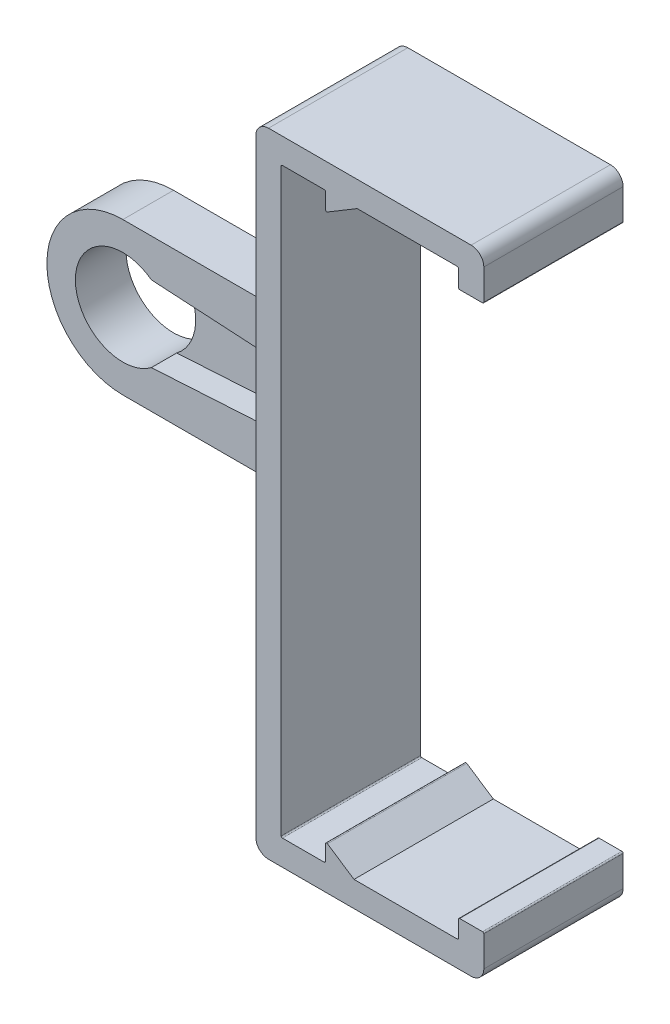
ISO-10303-21;
HEADER;
FILE_DESCRIPTION(('STEP AP214'),'2;1');
FILE_NAME('part.step','',(''),(''),'','','');
FILE_SCHEMA(('AUTOMOTIVE_DESIGN { 1 0 10303 214 1 1 1 1 }'));
ENDSEC;
DATA;
#1=APPLICATION_CONTEXT('core data for automotive mechanical design processes');
#2=APPLICATION_PROTOCOL_DEFINITION('international standard','automotive_design',2000,#1);
#3=PRODUCT_CONTEXT('',#1,'mechanical');
#4=PRODUCT('Part','Part','',(#3));
#5=PRODUCT_RELATED_PRODUCT_CATEGORY('part','',(#4));
#6=PRODUCT_DEFINITION_FORMATION('','',#4);
#7=PRODUCT_DEFINITION_CONTEXT('part definition',#1,'design');
#8=PRODUCT_DEFINITION('design','',#6,#7);
#9=PRODUCT_DEFINITION_SHAPE('','',#8);
#10=(LENGTH_UNIT() NAMED_UNIT(*) SI_UNIT(.MILLI.,.METRE.));
#11=(NAMED_UNIT(*) PLANE_ANGLE_UNIT() SI_UNIT($,.RADIAN.));
#12=(NAMED_UNIT(*) SI_UNIT($,.STERADIAN.) SOLID_ANGLE_UNIT());
#13=UNCERTAINTY_MEASURE_WITH_UNIT(LENGTH_MEASURE(1.E-05),#10,'distance_accuracy_value','');
#14=(GEOMETRIC_REPRESENTATION_CONTEXT(3) GLOBAL_UNCERTAINTY_ASSIGNED_CONTEXT((#13)) GLOBAL_UNIT_ASSIGNED_CONTEXT((#10,
#11,#12)) REPRESENTATION_CONTEXT('',''));
#15=CARTESIAN_POINT('',(0.,0.,0.));
#16=DIRECTION('',(0.,0.,1.));
#17=DIRECTION('',(1.,0.,0.));
#18=AXIS2_PLACEMENT_3D('',#15,#16,#17);
#19=CARTESIAN_POINT('',(52.0828071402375,0.,0.));
#20=DIRECTION('',(-1.,0.,0.));
#21=DIRECTION('',(0.,-1.,0.));
#22=AXIS2_PLACEMENT_3D('',#19,#20,#21);
#23=PLANE('',#22);
#24=DIRECTION('',(0.,-1.,0.));
#25=VECTOR('',#24,1.);
#26=CARTESIAN_POINT('',(52.0828071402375,-37.9023379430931,11.));
#27=LINE('',#26,#25);
#28=CARTESIAN_POINT('',(52.0828071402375,-34.5023379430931,11.));
#29=VERTEX_POINT('',#28);
#30=CARTESIAN_POINT('',(52.0828071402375,-36.9023379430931,11.));
#31=VERTEX_POINT('',#30);
#32=EDGE_CURVE('E405',#29,#31,#27,.T.);
#33=ORIENTED_EDGE('',*,*,#32,.T.);
#34=DIRECTION('',(0.,0.,-1.));
#35=VECTOR('',#34,1.);
#36=CARTESIAN_POINT('',(52.0828071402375,-36.9023379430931,0.));
#37=LINE('',#36,#35);
#38=CARTESIAN_POINT('',(52.0828071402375,-36.9023379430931,0.));
#39=VERTEX_POINT('',#38);
#40=EDGE_CURVE('E625',#31,#39,#37,.T.);
#41=ORIENTED_EDGE('',*,*,#40,.T.);
#42=DIRECTION('',(0.,1.,0.));
#43=VECTOR('',#42,1.);
#44=CARTESIAN_POINT('',(52.0828071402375,-37.9023379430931,0.));
#45=LINE('',#44,#43);
#46=CARTESIAN_POINT('',(52.0828071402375,-34.5023379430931,0.));
#47=VERTEX_POINT('',#46);
#48=EDGE_CURVE('E406',#39,#47,#45,.T.);
#49=ORIENTED_EDGE('',*,*,#48,.T.);
#50=DIRECTION('',(0.,0.,1.));
#51=VECTOR('',#50,1.);
#52=CARTESIAN_POINT('',(52.0828071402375,-34.5023379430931,0.));
#53=LINE('',#52,#51);
#54=EDGE_CURVE('E520',#47,#29,#53,.T.);
#55=ORIENTED_EDGE('',*,*,#54,.T.);
#56=EDGE_LOOP('',(#33,#41,#49,#55));
#57=FACE_BOUND('',#56,.T.);
#58=ADVANCED_FACE('F33',(#57),#23,.F.);
#59=CARTESIAN_POINT('',(16.5828071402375,-12.9023379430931,4.));
#60=DIRECTION('',(0.,0.,1.));
#61=DIRECTION('',(1.,0.,0.));
#62=AXIS2_PLACEMENT_3D('',#59,#60,#61);
#63=PLANE('',#62);
#64=DIRECTION('',(0.,-1.,0.));
#65=VECTOR('',#64,1.);
#66=CARTESIAN_POINT('',(34.0828071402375,-12.9023379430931,4.));
#67=LINE('',#66,#65);
#68=CARTESIAN_POINT('',(34.0828071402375,-5.90233794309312,4.));
#69=VERTEX_POINT('',#68);
#70=CARTESIAN_POINT('',(34.0828071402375,-19.9023379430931,4.));
#71=VERTEX_POINT('',#70);
#72=EDGE_CURVE('E425',#69,#71,#67,.T.);
#73=ORIENTED_EDGE('',*,*,#72,.F.);
#74=CARTESIAN_POINT('',(33.0828071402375,-5.90233794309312,4.));
#75=DIRECTION('',(0.,0.,1.));
#76=DIRECTION('',(1.,0.,0.));
#77=AXIS2_PLACEMENT_3D('',#74,#75,#76);
#78=CIRCLE('',#77,1.);
#79=CARTESIAN_POINT('',(33.0828071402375,-6.90233794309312,4.));
#80=VERTEX_POINT('',#79);
#81=EDGE_CURVE('E634',#69,#80,#78,.F.);
#82=ORIENTED_EDGE('',*,*,#81,.T.);
#83=DIRECTION('',(-1.,0.,0.));
#84=VECTOR('',#83,1.);
#85=CARTESIAN_POINT('',(36.5828071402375,-6.90233794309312,4.));
#86=LINE('',#85,#84);
#87=CARTESIAN_POINT('',(16.5828071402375,-6.90233794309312,4.));
#88=VERTEX_POINT('',#87);
#89=EDGE_CURVE('E462',#80,#88,#86,.T.);
#90=ORIENTED_EDGE('',*,*,#89,.T.);
#91=CARTESIAN_POINT('',(16.5828071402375,-12.9023379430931,4.));
#92=DIRECTION('',(0.,0.,1.));
#93=DIRECTION('',(1.,0.,0.));
#94=AXIS2_PLACEMENT_3D('',#91,#92,#93);
#95=CIRCLE('',#94,6.);
#96=CARTESIAN_POINT('',(16.5828071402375,-18.9023379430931,4.));
#97=VERTEX_POINT('',#96);
#98=EDGE_CURVE('E465',#88,#97,#95,.T.);
#99=ORIENTED_EDGE('',*,*,#98,.T.);
#100=DIRECTION('',(1.,0.,0.));
#101=VECTOR('',#100,1.);
#102=CARTESIAN_POINT('',(36.5828071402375,-18.9023379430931,4.));
#103=LINE('',#102,#101);
#104=CARTESIAN_POINT('',(33.0828071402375,-18.9023379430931,4.));
#105=VERTEX_POINT('',#104);
#106=EDGE_CURVE('E459',#97,#105,#103,.T.);
#107=ORIENTED_EDGE('',*,*,#106,.T.);
#108=CARTESIAN_POINT('',(33.0828071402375,-19.9023379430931,4.));
#109=DIRECTION('',(0.,0.,1.));
#110=DIRECTION('',(1.,0.,0.));
#111=AXIS2_PLACEMENT_3D('',#108,#109,#110);
#112=CIRCLE('',#111,1.);
#113=EDGE_CURVE('E41',#105,#71,#112,.F.);
#114=ORIENTED_EDGE('',*,*,#113,.T.);
#115=EDGE_LOOP('',(#73,#82,#90,#99,#107,#114));
#116=FACE_BOUND('',#115,.T.);
#117=DIRECTION('',(0.998274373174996,0.0587220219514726,0.));
#118=VECTOR('',#117,1.);
#119=CARTESIAN_POINT('',(31.5828071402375,-15.1523379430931,4.));
#120=LINE('',#119,#118);
#121=CARTESIAN_POINT('',(18.8328071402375,-15.9023379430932,4.));
#122=VERTEX_POINT('',#121);
#123=CARTESIAN_POINT('',(31.5828071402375,-15.1523379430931,4.));
#124=VERTEX_POINT('',#123);
#125=EDGE_CURVE('E432',#122,#124,#120,.T.);
#126=ORIENTED_EDGE('',*,*,#125,.F.);
#127=CARTESIAN_POINT('',(16.5828071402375,-12.9023379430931,4.));
#128=DIRECTION('',(0.,0.,1.));
#129=DIRECTION('',(1.,0.,0.));
#130=AXIS2_PLACEMENT_3D('',#127,#128,#129);
#131=CIRCLE('',#130,3.75);
#132=CARTESIAN_POINT('',(18.8328071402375,-9.90233794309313,4.));
#133=VERTEX_POINT('',#132);
#134=EDGE_CURVE('E453',#133,#122,#131,.T.);
#135=ORIENTED_EDGE('',*,*,#134,.F.);
#136=DIRECTION('',(-0.998274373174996,0.0587220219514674,0.));
#137=VECTOR('',#136,1.);
#138=CARTESIAN_POINT('',(31.5828071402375,-10.6523379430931,4.));
#139=LINE('',#138,#137);
#140=CARTESIAN_POINT('',(31.5828071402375,-10.6523379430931,4.));
#141=VERTEX_POINT('',#140);
#142=EDGE_CURVE('E440',#141,#133,#139,.T.);
#143=ORIENTED_EDGE('',*,*,#142,.F.);
#144=CARTESIAN_POINT('',(31.5828071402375,-12.9023379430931,4.));
#145=DIRECTION('',(0.,0.,1.));
#146=DIRECTION('',(1.,0.,0.));
#147=AXIS2_PLACEMENT_3D('',#144,#145,#146);
#148=CIRCLE('',#147,2.25);
#149=EDGE_CURVE('E427',#124,#141,#148,.T.);
#150=ORIENTED_EDGE('',*,*,#149,.F.);
#151=EDGE_LOOP('',(#126,#135,#143,#150));
#152=FACE_BOUND('',#151,.T.);
#153=ADVANCED_FACE('F638',(#116,#152),#63,.T.);
#154=CARTESIAN_POINT('',(16.5828071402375,-12.9023379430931,0.));
#155=DIRECTION('',(0.,0.,1.));
#156=DIRECTION('',(1.,0.,0.));
#157=AXIS2_PLACEMENT_3D('',#154,#155,#156);
#158=PLANE('',#157);
#159=DIRECTION('',(0.,1.,0.));
#160=VECTOR('',#159,1.);
#161=CARTESIAN_POINT('',(34.0828071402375,-37.9023379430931,0.));
#162=LINE('',#161,#160);
#163=CARTESIAN_POINT('',(34.0828071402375,-5.90233794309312,0.));
#164=VERTEX_POINT('',#163);
#165=CARTESIAN_POINT('',(34.0828071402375,11.0976620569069,0.));
#166=VERTEX_POINT('',#165);
#167=EDGE_CURVE('E411',#164,#166,#162,.T.);
#168=ORIENTED_EDGE('',*,*,#167,.T.);
#169=CARTESIAN_POINT('',(35.0828071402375,11.0976620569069,0.));
#170=DIRECTION('',(0.,0.,1.));
#171=DIRECTION('',(1.,0.,0.));
#172=AXIS2_PLACEMENT_3D('',#169,#170,#171);
#173=CIRCLE('',#172,1.);
#174=CARTESIAN_POINT('',(35.0828071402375,12.0976620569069,0.));
#175=VERTEX_POINT('',#174);
#176=EDGE_CURVE('E620',#166,#175,#173,.F.);
#177=ORIENTED_EDGE('',*,*,#176,.T.);
#178=DIRECTION('',(-1.,0.,0.));
#179=VECTOR('',#178,1.);
#180=CARTESIAN_POINT('',(52.0828071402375,12.0976620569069,0.));
#181=LINE('',#180,#179);
#182=CARTESIAN_POINT('',(51.0828071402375,12.0976620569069,0.));
#183=VERTEX_POINT('',#182);
#184=EDGE_CURVE('E416',#183,#175,#181,.T.);
#185=ORIENTED_EDGE('',*,*,#184,.F.);
#186=CARTESIAN_POINT('',(51.0828071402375,11.0976620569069,0.));
#187=DIRECTION('',(0.,0.,1.));
#188=DIRECTION('',(1.,0.,0.));
#189=AXIS2_PLACEMENT_3D('',#186,#187,#188);
#190=CIRCLE('',#189,1.);
#191=CARTESIAN_POINT('',(52.0828071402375,11.0976620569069,0.));
#192=VERTEX_POINT('',#191);
#193=EDGE_CURVE('E48',#183,#192,#190,.F.);
#194=ORIENTED_EDGE('',*,*,#193,.T.);
#195=CARTESIAN_POINT('',(52.0828071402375,8.69766205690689,0.));
#196=VERTEX_POINT('',#195);
#197=EDGE_CURVE('E404',#196,#192,#45,.T.);
#198=ORIENTED_EDGE('',*,*,#197,.F.);
#199=CARTESIAN_POINT('',(51.9828071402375,8.69766205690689,0.));
#200=DIRECTION('',(0.,0.,1.));
#201=DIRECTION('',(1.,0.,0.));
#202=AXIS2_PLACEMENT_3D('',#199,#200,#201);
#203=CIRCLE('',#202,0.1);
#204=CARTESIAN_POINT('',(51.9828071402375,8.59766205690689,0.));
#205=VERTEX_POINT('',#204);
#206=EDGE_CURVE('E549',#196,#205,#203,.F.);
#207=ORIENTED_EDGE('',*,*,#206,.T.);
#208=DIRECTION('',(-1.,0.,0.));
#209=VECTOR('',#208,1.);
#210=CARTESIAN_POINT('',(16.5828071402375,8.59766205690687,0.));
#211=LINE('',#210,#209);
#212=CARTESIAN_POINT('',(50.1828071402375,8.59766205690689,0.));
#213=VERTEX_POINT('',#212);
#214=EDGE_CURVE('E395',#205,#213,#211,.T.);
#215=ORIENTED_EDGE('',*,*,#214,.T.);
#216=CARTESIAN_POINT('',(50.1828071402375,8.69766205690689,0.));
#217=DIRECTION('',(0.,0.,1.));
#218=DIRECTION('',(1.,0.,0.));
#219=AXIS2_PLACEMENT_3D('',#216,#217,#218);
#220=CIRCLE('',#219,0.1);
#221=CARTESIAN_POINT('',(50.0828071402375,8.69766205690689,0.));
#222=VERTEX_POINT('',#221);
#223=EDGE_CURVE('E547',#213,#222,#220,.F.);
#224=ORIENTED_EDGE('',*,*,#223,.T.);
#225=DIRECTION('',(0.,1.,0.));
#226=VECTOR('',#225,1.);
#227=CARTESIAN_POINT('',(50.0828071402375,-12.9023379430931,0.));
#228=LINE('',#227,#226);
#229=CARTESIAN_POINT('',(50.0828071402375,9.99766205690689,0.));
#230=VERTEX_POINT('',#229);
#231=EDGE_CURVE('E361',#222,#230,#228,.T.);
#232=ORIENTED_EDGE('',*,*,#231,.T.);
#233=CARTESIAN_POINT('',(49.9828071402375,9.99766205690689,0.));
#234=DIRECTION('',(0.,0.,1.));
#235=DIRECTION('',(1.,0.,0.));
#236=AXIS2_PLACEMENT_3D('',#233,#234,#235);
#237=CIRCLE('',#236,0.1);
#238=CARTESIAN_POINT('',(49.9828071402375,10.0976620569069,0.));
#239=VERTEX_POINT('',#238);
#240=EDGE_CURVE('E574',#230,#239,#237,.T.);
#241=ORIENTED_EDGE('',*,*,#240,.T.);
#242=DIRECTION('',(-1.,0.,0.));
#243=VECTOR('',#242,1.);
#244=CARTESIAN_POINT('',(16.5828071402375,10.0976620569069,0.));
#245=LINE('',#244,#243);
#246=CARTESIAN_POINT('',(42.0828071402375,10.0976620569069,0.));
#247=VERTEX_POINT('',#246);
#248=EDGE_CURVE('E381',#239,#247,#245,.T.);
#249=ORIENTED_EDGE('',*,*,#248,.T.);
#250=DIRECTION('',(-0.857492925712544,-0.514495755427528,0.));
#251=VECTOR('',#250,1.);
#252=CARTESIAN_POINT('',(13.1857483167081,-7.24057323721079,0.));
#253=LINE('',#252,#251);
#254=CARTESIAN_POINT('',(39.7342567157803,8.68853180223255,0.));
#255=VERTEX_POINT('',#254);
#256=EDGE_CURVE('E366',#247,#255,#253,.T.);
#257=ORIENTED_EDGE('',*,*,#256,.T.);
#258=CARTESIAN_POINT('',(39.6828071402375,8.7742810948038,0.));
#259=DIRECTION('',(0.,0.,1.));
#260=DIRECTION('',(1.,0.,0.));
#261=AXIS2_PLACEMENT_3D('',#258,#259,#260);
#262=CIRCLE('',#261,0.1);
#263=CARTESIAN_POINT('',(39.5828071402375,8.7742810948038,0.));
#264=VERTEX_POINT('',#263);
#265=EDGE_CURVE('E541',#255,#264,#262,.F.);
#266=ORIENTED_EDGE('',*,*,#265,.T.);
#267=DIRECTION('',(0.,1.,0.));
#268=VECTOR('',#267,1.);
#269=CARTESIAN_POINT('',(39.5828071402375,-12.9023379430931,0.));
#270=LINE('',#269,#268);
#271=CARTESIAN_POINT('',(39.5828071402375,9.99766205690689,0.));
#272=VERTEX_POINT('',#271);
#273=EDGE_CURVE('E369',#264,#272,#270,.T.);
#274=ORIENTED_EDGE('',*,*,#273,.T.);
#275=CARTESIAN_POINT('',(39.4828071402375,9.99766205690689,0.));
#276=DIRECTION('',(0.,0.,1.));
#277=DIRECTION('',(1.,0.,0.));
#278=AXIS2_PLACEMENT_3D('',#275,#276,#277);
#279=CIRCLE('',#278,0.1);
#280=CARTESIAN_POINT('',(39.4828071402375,10.0976620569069,0.));
#281=VERTEX_POINT('',#280);
#282=EDGE_CURVE('E578',#272,#281,#279,.T.);
#283=ORIENTED_EDGE('',*,*,#282,.T.);
#284=DIRECTION('',(-1.,0.,0.));
#285=VECTOR('',#284,1.);
#286=CARTESIAN_POINT('',(16.5828071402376,10.0976620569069,0.));
#287=LINE('',#286,#285);
#288=CARTESIAN_POINT('',(36.1828071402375,10.0976620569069,0.));
#289=VERTEX_POINT('',#288);
#290=EDGE_CURVE('E383',#281,#289,#287,.T.);
#291=ORIENTED_EDGE('',*,*,#290,.T.);
#292=CARTESIAN_POINT('',(36.1828071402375,9.99766205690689,0.));
#293=DIRECTION('',(0.,0.,1.));
#294=DIRECTION('',(1.,0.,0.));
#295=AXIS2_PLACEMENT_3D('',#292,#293,#294);
#296=CIRCLE('',#295,0.1);
#297=CARTESIAN_POINT('',(36.0828071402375,9.99766205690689,0.));
#298=VERTEX_POINT('',#297);
#299=EDGE_CURVE('E582',#289,#298,#296,.T.);
#300=ORIENTED_EDGE('',*,*,#299,.T.);
#301=DIRECTION('',(0.,-1.,0.));
#302=VECTOR('',#301,1.);
#303=CARTESIAN_POINT('',(36.0828071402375,-12.9023379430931,0.));
#304=LINE('',#303,#302);
#305=CARTESIAN_POINT('',(36.0828071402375,-35.8023379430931,0.));
#306=VERTEX_POINT('',#305);
#307=EDGE_CURVE('E386',#298,#306,#304,.T.);
#308=ORIENTED_EDGE('',*,*,#307,.T.);
#309=CARTESIAN_POINT('',(36.1828071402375,-35.8023379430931,0.));
#310=DIRECTION('',(0.,0.,1.));
#311=DIRECTION('',(1.,0.,0.));
#312=AXIS2_PLACEMENT_3D('',#309,#310,#311);
#313=CIRCLE('',#312,0.1);
#314=CARTESIAN_POINT('',(36.1828071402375,-35.9023379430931,0.));
#315=VERTEX_POINT('',#314);
#316=EDGE_CURVE('E586',#306,#315,#313,.T.);
#317=ORIENTED_EDGE('',*,*,#316,.T.);
#318=DIRECTION('',(1.,0.,0.));
#319=VECTOR('',#318,1.);
#320=CARTESIAN_POINT('',(16.5828071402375,-35.9023379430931,0.));
#321=LINE('',#320,#319);
#322=CARTESIAN_POINT('',(39.4828071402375,-35.9023379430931,0.));
#323=VERTEX_POINT('',#322);
#324=EDGE_CURVE('E372',#315,#323,#321,.T.);
#325=ORIENTED_EDGE('',*,*,#324,.T.);
#326=CARTESIAN_POINT('',(39.4828071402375,-35.8023379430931,0.));
#327=DIRECTION('',(0.,0.,1.));
#328=DIRECTION('',(1.,0.,0.));
#329=AXIS2_PLACEMENT_3D('',#326,#327,#328);
#330=CIRCLE('',#329,0.1);
#331=CARTESIAN_POINT('',(39.5828071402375,-35.8023379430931,0.));
#332=VERTEX_POINT('',#331);
#333=EDGE_CURVE('E570',#323,#332,#330,.T.);
#334=ORIENTED_EDGE('',*,*,#333,.T.);
#335=DIRECTION('',(0.,1.,0.));
#336=VECTOR('',#335,1.);
#337=CARTESIAN_POINT('',(39.5828071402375,-12.9023379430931,0.));
#338=LINE('',#337,#336);
#339=CARTESIAN_POINT('',(39.5828071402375,-34.5938021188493,0.));
#340=VERTEX_POINT('',#339);
#341=EDGE_CURVE('E375',#332,#340,#338,.T.);
#342=ORIENTED_EDGE('',*,*,#341,.T.);
#343=CARTESIAN_POINT('',(39.6828071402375,-34.5938021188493,0.));
#344=DIRECTION('',(0.,0.,1.));
#345=DIRECTION('',(1.,0.,0.));
#346=AXIS2_PLACEMENT_3D('',#343,#344,#345);
#347=CIRCLE('',#346,0.1);
#348=CARTESIAN_POINT('',(39.7381501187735,-34.5105125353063,0.));
#349=VERTEX_POINT('',#348);
#350=EDGE_CURVE('E543',#340,#349,#347,.F.);
#351=ORIENTED_EDGE('',*,*,#350,.T.);
#352=DIRECTION('',(0.832895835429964,-0.553429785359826,0.));
#353=VECTOR('',#352,1.);
#354=CARTESIAN_POINT('',(13.7146560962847,-17.2188223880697,0.));
#355=LINE('',#354,#353);
#356=CARTESIAN_POINT('',(41.8328071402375,-35.9023379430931,0.));
#357=VERTEX_POINT('',#356);
#358=EDGE_CURVE('E378',#349,#357,#355,.T.);
#359=ORIENTED_EDGE('',*,*,#358,.T.);
#360=DIRECTION('',(1.,0.,0.));
#361=VECTOR('',#360,1.);
#362=CARTESIAN_POINT('',(16.5828071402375,-35.9023379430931,0.));
#363=LINE('',#362,#361);
#364=CARTESIAN_POINT('',(49.9828071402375,-35.9023379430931,0.));
#365=VERTEX_POINT('',#364);
#366=EDGE_CURVE('E335',#357,#365,#363,.T.);
#367=ORIENTED_EDGE('',*,*,#366,.T.);
#368=CARTESIAN_POINT('',(49.9828071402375,-35.8023379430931,0.));
#369=DIRECTION('',(0.,0.,1.));
#370=DIRECTION('',(1.,0.,0.));
#371=AXIS2_PLACEMENT_3D('',#368,#369,#370);
#372=CIRCLE('',#371,0.1);
#373=CARTESIAN_POINT('',(50.0828071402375,-35.8023379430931,0.));
#374=VERTEX_POINT('',#373);
#375=EDGE_CURVE('E566',#365,#374,#372,.T.);
#376=ORIENTED_EDGE('',*,*,#375,.T.);
#377=CARTESIAN_POINT('',(50.0828071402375,-34.5023379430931,0.));
#378=VERTEX_POINT('',#377);
#379=EDGE_CURVE('E365',#374,#378,#228,.T.);
#380=ORIENTED_EDGE('',*,*,#379,.T.);
#381=CARTESIAN_POINT('',(50.1828071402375,-34.5023379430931,0.));
#382=DIRECTION('',(0.,0.,1.));
#383=DIRECTION('',(1.,0.,0.));
#384=AXIS2_PLACEMENT_3D('',#381,#382,#383);
#385=CIRCLE('',#384,0.1);
#386=CARTESIAN_POINT('',(50.1828071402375,-34.4023379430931,0.));
#387=VERTEX_POINT('',#386);
#388=EDGE_CURVE('E545',#378,#387,#385,.F.);
#389=ORIENTED_EDGE('',*,*,#388,.T.);
#390=DIRECTION('',(1.,0.,0.));
#391=VECTOR('',#390,1.);
#392=CARTESIAN_POINT('',(16.5828071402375,-34.4023379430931,0.));
#393=LINE('',#392,#391);
#394=CARTESIAN_POINT('',(51.9828071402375,-34.4023379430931,0.));
#395=VERTEX_POINT('',#394);
#396=EDGE_CURVE('E398',#387,#395,#393,.T.);
#397=ORIENTED_EDGE('',*,*,#396,.T.);
#398=CARTESIAN_POINT('',(51.9828071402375,-34.5023379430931,0.));
#399=DIRECTION('',(0.,0.,1.));
#400=DIRECTION('',(1.,0.,0.));
#401=AXIS2_PLACEMENT_3D('',#398,#399,#400);
#402=CIRCLE('',#401,0.1);
#403=EDGE_CURVE('E551',#395,#47,#402,.F.);
#404=ORIENTED_EDGE('',*,*,#403,.T.);
#405=ORIENTED_EDGE('',*,*,#48,.F.);
#406=CARTESIAN_POINT('',(51.0828071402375,-36.9023379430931,0.));
#407=DIRECTION('',(0.,0.,1.));
#408=DIRECTION('',(1.,0.,0.));
#409=AXIS2_PLACEMENT_3D('',#406,#407,#408);
#410=CIRCLE('',#409,1.);
#411=CARTESIAN_POINT('',(51.0828071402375,-37.9023379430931,0.));
#412=VERTEX_POINT('',#411);
#413=EDGE_CURVE('E617',#39,#412,#410,.F.);
#414=ORIENTED_EDGE('',*,*,#413,.T.);
#415=DIRECTION('',(-1.,0.,0.));
#416=VECTOR('',#415,1.);
#417=CARTESIAN_POINT('',(52.0828071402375,-37.9023379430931,0.));
#418=LINE('',#417,#416);
#419=CARTESIAN_POINT('',(35.0828071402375,-37.9023379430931,0.));
#420=VERTEX_POINT('',#419);
#421=EDGE_CURVE('E419',#412,#420,#418,.T.);
#422=ORIENTED_EDGE('',*,*,#421,.T.);
#423=CARTESIAN_POINT('',(35.0828071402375,-36.9023379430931,0.));
#424=DIRECTION('',(0.,0.,1.));
#425=DIRECTION('',(1.,0.,0.));
#426=AXIS2_PLACEMENT_3D('',#423,#424,#425);
#427=CIRCLE('',#426,1.);
#428=CARTESIAN_POINT('',(34.0828071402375,-36.9023379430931,0.));
#429=VERTEX_POINT('',#428);
#430=EDGE_CURVE('E56',#420,#429,#427,.F.);
#431=ORIENTED_EDGE('',*,*,#430,.T.);
#432=CARTESIAN_POINT('',(34.0828071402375,-19.9023379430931,0.));
#433=VERTEX_POINT('',#432);
#434=EDGE_CURVE('E414',#429,#433,#162,.T.);
#435=ORIENTED_EDGE('',*,*,#434,.T.);
#436=CARTESIAN_POINT('',(33.0828071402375,-19.9023379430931,0.));
#437=DIRECTION('',(0.,0.,1.));
#438=DIRECTION('',(1.,0.,0.));
#439=AXIS2_PLACEMENT_3D('',#436,#437,#438);
#440=CIRCLE('',#439,1.);
#441=CARTESIAN_POINT('',(33.0828071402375,-18.9023379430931,0.));
#442=VERTEX_POINT('',#441);
#443=EDGE_CURVE('E11',#433,#442,#440,.T.);
#444=ORIENTED_EDGE('',*,*,#443,.T.);
#445=DIRECTION('',(1.,0.,0.));
#446=VECTOR('',#445,1.);
#447=CARTESIAN_POINT('',(36.5828071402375,-18.9023379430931,0.));
#448=LINE('',#447,#446);
#449=CARTESIAN_POINT('',(16.5828071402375,-18.9023379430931,0.));
#450=VERTEX_POINT('',#449);
#451=EDGE_CURVE('E456',#450,#442,#448,.T.);
#452=ORIENTED_EDGE('',*,*,#451,.F.);
#453=CARTESIAN_POINT('',(16.5828071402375,-12.9023379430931,0.));
#454=DIRECTION('',(0.,0.,1.));
#455=DIRECTION('',(1.,0.,0.));
#456=AXIS2_PLACEMENT_3D('',#453,#454,#455);
#457=CIRCLE('',#456,6.);
#458=CARTESIAN_POINT('',(16.5828071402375,-6.90233794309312,0.));
#459=VERTEX_POINT('',#458);
#460=EDGE_CURVE('E463',#459,#450,#457,.T.);
#461=ORIENTED_EDGE('',*,*,#460,.F.);
#462=DIRECTION('',(-1.,0.,0.));
#463=VECTOR('',#462,1.);
#464=CARTESIAN_POINT('',(36.5828071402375,-6.90233794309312,0.));
#465=LINE('',#464,#463);
#466=CARTESIAN_POINT('',(33.0828071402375,-6.90233794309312,0.));
#467=VERTEX_POINT('',#466);
#468=EDGE_CURVE('E470',#467,#459,#465,.T.);
#469=ORIENTED_EDGE('',*,*,#468,.F.);
#470=CARTESIAN_POINT('',(33.0828071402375,-5.90233794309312,0.));
#471=DIRECTION('',(0.,0.,1.));
#472=DIRECTION('',(1.,0.,0.));
#473=AXIS2_PLACEMENT_3D('',#470,#471,#472);
#474=CIRCLE('',#473,1.);
#475=EDGE_CURVE('E632',#467,#164,#474,.T.);
#476=ORIENTED_EDGE('',*,*,#475,.T.);
#477=EDGE_LOOP('',(#168,#177,#185,#194,#198,#207,#215,#224,#232,#241,#249,#257,#266,#274,#283,
#291,#300,#308,#317,#325,#334,#342,#351,#359,#367,#376,#380,#389,#397,#404,#405,#414,#422,#431,
#435,#444,#452,#461,#469,#476));
#478=FACE_BOUND('',#477,.T.);
#479=CARTESIAN_POINT('',(16.5828071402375,-12.9023379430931,0.));
#480=DIRECTION('',(0.,0.,1.));
#481=DIRECTION('',(1.,0.,0.));
#482=AXIS2_PLACEMENT_3D('',#479,#480,#481);
#483=CIRCLE('',#482,3.75);
#484=CARTESIAN_POINT('',(20.3328071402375,-12.9023379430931,0.));
#485=VERTEX_POINT('',#484);
#486=EDGE_CURVE('E446',#485,#485,#483,.T.);
#487=ORIENTED_EDGE('',*,*,#486,.T.);
#488=EDGE_LOOP('',(#487));
#489=FACE_BOUND('',#488,.T.);
#490=ADVANCED_FACE('F650',(#478,#489),#158,.F.);
#491=CARTESIAN_POINT('',(36.5828071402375,-18.9023379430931,4.));
#492=DIRECTION('',(0.,1.,0.));
#493=DIRECTION('',(0.,0.,1.));
#494=AXIS2_PLACEMENT_3D('',#491,#492,#493);
#495=PLANE('',#494);
#496=ORIENTED_EDGE('',*,*,#451,.T.);
#497=DIRECTION('',(0.,0.,1.));
#498=VECTOR('',#497,1.);
#499=CARTESIAN_POINT('',(33.0828071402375,-18.9023379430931,4.));
#500=LINE('',#499,#498);
#501=EDGE_CURVE('E600',#442,#105,#500,.T.);
#502=ORIENTED_EDGE('',*,*,#501,.T.);
#503=ORIENTED_EDGE('',*,*,#106,.F.);
#504=DIRECTION('',(0.,0.,-1.));
#505=VECTOR('',#504,1.);
#506=CARTESIAN_POINT('',(16.5828071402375,-18.9023379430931,4.));
#507=LINE('',#506,#505);
#508=EDGE_CURVE('E467',#97,#450,#507,.T.);
#509=ORIENTED_EDGE('',*,*,#508,.T.);
#510=EDGE_LOOP('',(#496,#502,#503,#509));
#511=FACE_BOUND('',#510,.T.);
#512=ADVANCED_FACE('F829',(#511),#495,.F.);
#513=CARTESIAN_POINT('',(36.5828071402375,-6.90233794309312,4.));
#514=DIRECTION('',(0.,-1.,0.));
#515=DIRECTION('',(1.,0.,0.));
#516=AXIS2_PLACEMENT_3D('',#513,#514,#515);
#517=PLANE('',#516);
#518=ORIENTED_EDGE('',*,*,#89,.F.);
#519=DIRECTION('',(0.,0.,-1.));
#520=VECTOR('',#519,1.);
#521=CARTESIAN_POINT('',(33.0828071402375,-6.90233794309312,4.));
#522=LINE('',#521,#520);
#523=EDGE_CURVE('E588',#80,#467,#522,.T.);
#524=ORIENTED_EDGE('',*,*,#523,.T.);
#525=ORIENTED_EDGE('',*,*,#468,.T.);
#526=DIRECTION('',(0.,0.,-1.));
#527=VECTOR('',#526,1.);
#528=CARTESIAN_POINT('',(16.5828071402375,-6.90233794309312,4.));
#529=LINE('',#528,#527);
#530=EDGE_CURVE('E475',#88,#459,#529,.T.);
#531=ORIENTED_EDGE('',*,*,#530,.F.);
#532=EDGE_LOOP('',(#518,#524,#525,#531));
#533=FACE_BOUND('',#532,.T.);
#534=ADVANCED_FACE('F832',(#533),#517,.F.);
#535=CARTESIAN_POINT('',(16.5828071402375,-12.9023379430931,4.));
#536=DIRECTION('',(0.,0.,-1.));
#537=DIRECTION('',(-1.,0.,0.));
#538=AXIS2_PLACEMENT_3D('',#535,#536,#537);
#539=CYLINDRICAL_SURFACE('',#538,6.);
#540=ORIENTED_EDGE('',*,*,#460,.T.);
#541=ORIENTED_EDGE('',*,*,#508,.F.);
#542=ORIENTED_EDGE('',*,*,#98,.F.);
#543=ORIENTED_EDGE('',*,*,#530,.T.);
#544=EDGE_LOOP('',(#540,#541,#542,#543));
#545=FACE_BOUND('',#544,.T.);
#546=ADVANCED_FACE('F824',(#545),#539,.T.);
#547=CARTESIAN_POINT('',(16.5828071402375,-12.9023379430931,4.));
#548=DIRECTION('',(0.,0.,-1.));
#549=DIRECTION('',(-1.,0.,0.));
#550=AXIS2_PLACEMENT_3D('',#547,#548,#549);
#551=CYLINDRICAL_SURFACE('',#550,3.75);
#552=DIRECTION('',(0.,0.,1.));
#553=VECTOR('',#552,1.);
#554=CARTESIAN_POINT('',(18.8328071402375,-15.9023379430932,2.));
#555=LINE('',#554,#553);
#556=CARTESIAN_POINT('',(18.8328071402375,-15.9023379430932,2.));
#557=VERTEX_POINT('',#556);
#558=EDGE_CURVE('E447',#557,#122,#555,.T.);
#559=ORIENTED_EDGE('',*,*,#558,.F.);
#560=CARTESIAN_POINT('',(16.5828071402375,-12.9023379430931,2.));
#561=DIRECTION('',(0.,0.,1.));
#562=DIRECTION('',(1.,0.,0.));
#563=AXIS2_PLACEMENT_3D('',#560,#561,#562);
#564=CIRCLE('',#563,3.75);
#565=CARTESIAN_POINT('',(18.8328071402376,-9.90233794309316,2.));
#566=VERTEX_POINT('',#565);
#567=EDGE_CURVE('E478',#557,#566,#564,.T.);
#568=ORIENTED_EDGE('',*,*,#567,.T.);
#569=DIRECTION('',(0.,0.,1.));
#570=VECTOR('',#569,1.);
#571=CARTESIAN_POINT('',(18.8328071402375,-9.90233794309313,2.));
#572=LINE('',#571,#570);
#573=EDGE_CURVE('E449',#566,#133,#572,.T.);
#574=ORIENTED_EDGE('',*,*,#573,.T.);
#575=ORIENTED_EDGE('',*,*,#134,.T.);
#576=EDGE_LOOP('',(#559,#568,#574,#575));
#577=FACE_BOUND('',#576,.T.);
#578=ORIENTED_EDGE('',*,*,#486,.F.);
#579=EDGE_LOOP('',(#578));
#580=FACE_BOUND('',#579,.T.);
#581=ADVANCED_FACE('F821',(#577,#580),#551,.F.);
#582=CARTESIAN_POINT('',(31.5828071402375,-12.9023379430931,2.));
#583=DIRECTION('',(0.,0.,1.));
#584=DIRECTION('',(1.,0.,0.));
#585=AXIS2_PLACEMENT_3D('',#582,#583,#584);
#586=CYLINDRICAL_SURFACE('',#585,2.25);
#587=ORIENTED_EDGE('',*,*,#149,.T.);
#588=DIRECTION('',(0.,0.,1.));
#589=VECTOR('',#588,1.);
#590=CARTESIAN_POINT('',(31.5828071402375,-10.6523379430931,2.));
#591=LINE('',#590,#589);
#592=CARTESIAN_POINT('',(31.5828071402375,-10.6523379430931,2.));
#593=VERTEX_POINT('',#592);
#594=EDGE_CURVE('E437',#593,#141,#591,.T.);
#595=ORIENTED_EDGE('',*,*,#594,.F.);
#596=CARTESIAN_POINT('',(31.5828071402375,-12.9023379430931,2.));
#597=DIRECTION('',(0.,0.,1.));
#598=DIRECTION('',(1.,0.,0.));
#599=AXIS2_PLACEMENT_3D('',#596,#597,#598);
#600=CIRCLE('',#599,2.25);
#601=CARTESIAN_POINT('',(31.5828071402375,-15.1523379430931,2.));
#602=VERTEX_POINT('',#601);
#603=EDGE_CURVE('E428',#602,#593,#600,.T.);
#604=ORIENTED_EDGE('',*,*,#603,.F.);
#605=DIRECTION('',(0.,0.,1.));
#606=VECTOR('',#605,1.);
#607=CARTESIAN_POINT('',(31.5828071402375,-15.1523379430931,2.));
#608=LINE('',#607,#606);
#609=EDGE_CURVE('E444',#602,#124,#608,.T.);
#610=ORIENTED_EDGE('',*,*,#609,.T.);
#611=EDGE_LOOP('',(#587,#595,#604,#610));
#612=FACE_BOUND('',#611,.T.);
#613=ADVANCED_FACE('F814',(#612),#586,.F.);
#614=CARTESIAN_POINT('',(31.5828071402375,-15.1523379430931,2.));
#615=DIRECTION('',(0.0587220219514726,-0.998274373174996,0.));
#616=DIRECTION('',(0.998274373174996,0.0587220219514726,0.));
#617=AXIS2_PLACEMENT_3D('',#614,#615,#616);
#618=PLANE('',#617);
#619=ORIENTED_EDGE('',*,*,#125,.T.);
#620=ORIENTED_EDGE('',*,*,#609,.F.);
#621=DIRECTION('',(0.998274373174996,0.0587220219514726,0.));
#622=VECTOR('',#621,1.);
#623=CARTESIAN_POINT('',(31.5828071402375,-15.1523379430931,2.));
#624=LINE('',#623,#622);
#625=EDGE_CURVE('E434',#557,#602,#624,.T.);
#626=ORIENTED_EDGE('',*,*,#625,.F.);
#627=ORIENTED_EDGE('',*,*,#558,.T.);
#628=EDGE_LOOP('',(#619,#620,#626,#627));
#629=FACE_BOUND('',#628,.T.);
#630=ADVANCED_FACE('F811',(#629),#618,.F.);
#631=CARTESIAN_POINT('',(31.5828071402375,-10.6523379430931,2.));
#632=DIRECTION('',(0.0587220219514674,0.998274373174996,0.));
#633=DIRECTION('',(-0.998274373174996,0.0587220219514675,0.));
#634=AXIS2_PLACEMENT_3D('',#631,#632,#633);
#635=PLANE('',#634);
#636=ORIENTED_EDGE('',*,*,#142,.T.);
#637=ORIENTED_EDGE('',*,*,#573,.F.);
#638=DIRECTION('',(-0.998274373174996,0.0587220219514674,0.));
#639=VECTOR('',#638,1.);
#640=CARTESIAN_POINT('',(31.5828071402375,-10.6523379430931,2.));
#641=LINE('',#640,#639);
#642=EDGE_CURVE('E431',#593,#566,#641,.T.);
#643=ORIENTED_EDGE('',*,*,#642,.F.);
#644=ORIENTED_EDGE('',*,*,#594,.T.);
#645=EDGE_LOOP('',(#636,#637,#643,#644));
#646=FACE_BOUND('',#645,.T.);
#647=ADVANCED_FACE('F809',(#646),#635,.F.);
#648=CARTESIAN_POINT('',(31.5828071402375,-12.9023379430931,2.));
#649=DIRECTION('',(0.,0.,1.));
#650=DIRECTION('',(1.,0.,0.));
#651=AXIS2_PLACEMENT_3D('',#648,#649,#650);
#652=PLANE('',#651);
#653=ORIENTED_EDGE('',*,*,#625,.T.);
#654=ORIENTED_EDGE('',*,*,#603,.T.);
#655=ORIENTED_EDGE('',*,*,#642,.T.);
#656=ORIENTED_EDGE('',*,*,#567,.F.);
#657=EDGE_LOOP('',(#653,#654,#655,#656));
#658=FACE_BOUND('',#657,.T.);
#659=ADVANCED_FACE('F806',(#658),#652,.T.);
#660=CARTESIAN_POINT('',(34.0828071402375,0.,0.));
#661=DIRECTION('',(-1.,0.,0.));
#662=DIRECTION('',(0.,-1.,0.));
#663=AXIS2_PLACEMENT_3D('',#660,#661,#662);
#664=PLANE('',#663);
#665=ORIENTED_EDGE('',*,*,#167,.F.);
#666=DIRECTION('',(0.,0.,-1.));
#667=VECTOR('',#666,1.);
#668=CARTESIAN_POINT('',(34.0828071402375,-5.90233794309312,0.));
#669=LINE('',#668,#667);
#670=EDGE_CURVE('E597',#164,#69,#669,.F.);
#671=ORIENTED_EDGE('',*,*,#670,.T.);
#672=ORIENTED_EDGE('',*,*,#72,.T.);
#673=DIRECTION('',(0.,0.,1.));
#674=VECTOR('',#673,1.);
#675=CARTESIAN_POINT('',(34.0828071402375,-19.9023379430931,0.));
#676=LINE('',#675,#674);
#677=EDGE_CURVE('E595',#71,#433,#676,.F.);
#678=ORIENTED_EDGE('',*,*,#677,.T.);
#679=ORIENTED_EDGE('',*,*,#434,.F.);
#680=DIRECTION('',(0.,0.,-1.));
#681=VECTOR('',#680,1.);
#682=CARTESIAN_POINT('',(34.0828071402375,-36.9023379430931,11.));
#683=LINE('',#682,#681);
#684=CARTESIAN_POINT('',(34.0828071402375,-36.9023379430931,11.));
#685=VERTEX_POINT('',#684);
#686=EDGE_CURVE('E591',#429,#685,#683,.F.);
#687=ORIENTED_EDGE('',*,*,#686,.T.);
#688=DIRECTION('',(0.,-1.,0.));
#689=VECTOR('',#688,1.);
#690=CARTESIAN_POINT('',(34.0828071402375,-37.9023379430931,11.));
#691=LINE('',#690,#689);
#692=CARTESIAN_POINT('',(34.0828071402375,11.0976620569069,11.));
#693=VERTEX_POINT('',#692);
#694=EDGE_CURVE('E401',#693,#685,#691,.T.);
#695=ORIENTED_EDGE('',*,*,#694,.F.);
#696=DIRECTION('',(0.,0.,1.));
#697=VECTOR('',#696,1.);
#698=CARTESIAN_POINT('',(34.0828071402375,11.0976620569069,0.));
#699=LINE('',#698,#697);
#700=EDGE_CURVE('E593',#693,#166,#699,.F.);
#701=ORIENTED_EDGE('',*,*,#700,.T.);
#702=EDGE_LOOP('',(#665,#671,#672,#678,#679,#687,#695,#701));
#703=FACE_BOUND('',#702,.T.);
#704=ADVANCED_FACE('F649',(#703),#664,.T.);
#705=CARTESIAN_POINT('',(52.0828071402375,-37.9023379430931,11.));
#706=DIRECTION('',(0.,0.,-1.));
#707=DIRECTION('',(0.,1.,0.));
#708=AXIS2_PLACEMENT_3D('',#705,#706,#707);
#709=PLANE('',#708);
#710=DIRECTION('',(-1.,0.,0.));
#711=VECTOR('',#710,1.);
#712=CARTESIAN_POINT('',(52.0828071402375,12.0976620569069,11.));
#713=LINE('',#712,#711);
#714=CARTESIAN_POINT('',(51.0828071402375,12.0976620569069,11.));
#715=VERTEX_POINT('',#714);
#716=CARTESIAN_POINT('',(35.0828071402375,12.0976620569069,11.));
#717=VERTEX_POINT('',#716);
#718=EDGE_CURVE('E408',#715,#717,#713,.T.);
#719=ORIENTED_EDGE('',*,*,#718,.T.);
#720=CARTESIAN_POINT('',(35.0828071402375,11.0976620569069,11.));
#721=DIRECTION('',(0.,0.,-1.));
#722=DIRECTION('',(0.,1.,0.));
#723=AXIS2_PLACEMENT_3D('',#720,#721,#722);
#724=CIRCLE('',#723,1.);
#725=EDGE_CURVE('E614',#717,#693,#724,.F.);
#726=ORIENTED_EDGE('',*,*,#725,.T.);
#727=ORIENTED_EDGE('',*,*,#694,.T.);
#728=CARTESIAN_POINT('',(35.0828071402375,-36.9023379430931,11.));
#729=DIRECTION('',(0.,0.,-1.));
#730=DIRECTION('',(0.,1.,0.));
#731=AXIS2_PLACEMENT_3D('',#728,#729,#730);
#732=CIRCLE('',#731,1.);
#733=CARTESIAN_POINT('',(35.0828071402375,-37.9023379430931,11.));
#734=VERTEX_POINT('',#733);
#735=EDGE_CURVE('E608',#685,#734,#732,.F.);
#736=ORIENTED_EDGE('',*,*,#735,.T.);
#737=DIRECTION('',(-1.,0.,0.));
#738=VECTOR('',#737,1.);
#739=CARTESIAN_POINT('',(52.0828071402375,-37.9023379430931,11.));
#740=LINE('',#739,#738);
#741=CARTESIAN_POINT('',(51.0828071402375,-37.9023379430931,11.));
#742=VERTEX_POINT('',#741);
#743=EDGE_CURVE('E422',#742,#734,#740,.T.);
#744=ORIENTED_EDGE('',*,*,#743,.F.);
#745=CARTESIAN_POINT('',(51.0828071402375,-36.9023379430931,11.));
#746=DIRECTION('',(0.,0.,-1.));
#747=DIRECTION('',(0.,1.,0.));
#748=AXIS2_PLACEMENT_3D('',#745,#746,#747);
#749=CIRCLE('',#748,1.);
#750=EDGE_CURVE('E610',#742,#31,#749,.F.);
#751=ORIENTED_EDGE('',*,*,#750,.T.);
#752=ORIENTED_EDGE('',*,*,#32,.F.);
#753=CARTESIAN_POINT('',(51.9828071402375,-34.5023379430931,11.));
#754=DIRECTION('',(0.,0.,-1.));
#755=DIRECTION('',(0.,1.,0.));
#756=AXIS2_PLACEMENT_3D('',#753,#754,#755);
#757=CIRCLE('',#756,0.1);
#758=CARTESIAN_POINT('',(51.9828071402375,-34.4023379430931,11.));
#759=VERTEX_POINT('',#758);
#760=EDGE_CURVE('E534',#29,#759,#757,.F.);
#761=ORIENTED_EDGE('',*,*,#760,.T.);
#762=DIRECTION('',(1.,0.,0.));
#763=VECTOR('',#762,1.);
#764=CARTESIAN_POINT('',(48.5828071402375,-34.4023379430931,11.));
#765=LINE('',#764,#763);
#766=CARTESIAN_POINT('',(50.1828071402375,-34.4023379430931,11.));
#767=VERTEX_POINT('',#766);
#768=EDGE_CURVE('E392',#767,#759,#765,.T.);
#769=ORIENTED_EDGE('',*,*,#768,.F.);
#770=CARTESIAN_POINT('',(50.1828071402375,-34.5023379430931,11.));
#771=DIRECTION('',(0.,0.,-1.));
#772=DIRECTION('',(0.,1.,0.));
#773=AXIS2_PLACEMENT_3D('',#770,#771,#772);
#774=CIRCLE('',#773,0.1);
#775=CARTESIAN_POINT('',(50.0828071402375,-34.5023379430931,11.));
#776=VERTEX_POINT('',#775);
#777=EDGE_CURVE('E527',#767,#776,#774,.F.);
#778=ORIENTED_EDGE('',*,*,#777,.T.);
#779=DIRECTION('',(0.,1.,0.));
#780=VECTOR('',#779,1.);
#781=CARTESIAN_POINT('',(50.0828071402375,10.0976620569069,11.));
#782=LINE('',#781,#780);
#783=CARTESIAN_POINT('',(50.0828071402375,-35.8023379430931,11.));
#784=VERTEX_POINT('',#783);
#785=EDGE_CURVE('E346',#784,#776,#782,.T.);
#786=ORIENTED_EDGE('',*,*,#785,.F.);
#787=CARTESIAN_POINT('',(49.9828071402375,-35.8023379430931,11.));
#788=DIRECTION('',(0.,0.,-1.));
#789=DIRECTION('',(0.,1.,0.));
#790=AXIS2_PLACEMENT_3D('',#787,#788,#789);
#791=CIRCLE('',#790,0.1);
#792=CARTESIAN_POINT('',(49.9828071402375,-35.9023379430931,11.));
#793=VERTEX_POINT('',#792);
#794=EDGE_CURVE('E342',#784,#793,#791,.T.);
#795=ORIENTED_EDGE('',*,*,#794,.T.);
#796=DIRECTION('',(1.,0.,0.));
#797=VECTOR('',#796,1.);
#798=CARTESIAN_POINT('',(41.8328071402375,-35.9023379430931,11.));
#799=LINE('',#798,#797);
#800=CARTESIAN_POINT('',(41.8328071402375,-35.9023379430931,11.));
#801=VERTEX_POINT('',#800);
#802=EDGE_CURVE('E326',#801,#793,#799,.T.);
#803=ORIENTED_EDGE('',*,*,#802,.F.);
#804=DIRECTION('',(0.832895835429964,-0.553429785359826,0.));
#805=VECTOR('',#804,1.);
#806=CARTESIAN_POINT('',(41.8328071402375,-35.9023379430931,11.));
#807=LINE('',#806,#805);
#808=CARTESIAN_POINT('',(39.7381501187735,-34.5105125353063,11.));
#809=VERTEX_POINT('',#808);
#810=EDGE_CURVE('E317',#809,#801,#807,.T.);
#811=ORIENTED_EDGE('',*,*,#810,.F.);
#812=CARTESIAN_POINT('',(39.6828071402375,-34.5938021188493,11.));
#813=DIRECTION('',(0.,0.,-1.));
#814=DIRECTION('',(0.,1.,0.));
#815=AXIS2_PLACEMENT_3D('',#812,#813,#814);
#816=CIRCLE('',#815,0.1);
#817=CARTESIAN_POINT('',(39.5828071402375,-34.5938021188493,11.));
#818=VERTEX_POINT('',#817);
#819=EDGE_CURVE('E525',#809,#818,#816,.F.);
#820=ORIENTED_EDGE('',*,*,#819,.T.);
#821=DIRECTION('',(0.,1.,0.));
#822=VECTOR('',#821,1.);
#823=CARTESIAN_POINT('',(39.5828071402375,-34.4072926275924,11.));
#824=LINE('',#823,#822);
#825=CARTESIAN_POINT('',(39.5828071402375,-35.8023379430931,11.));
#826=VERTEX_POINT('',#825);
#827=EDGE_CURVE('E327',#826,#818,#824,.T.);
#828=ORIENTED_EDGE('',*,*,#827,.F.);
#829=CARTESIAN_POINT('',(39.4828071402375,-35.8023379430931,11.));
#830=DIRECTION('',(0.,0.,-1.));
#831=DIRECTION('',(0.,1.,0.));
#832=AXIS2_PLACEMENT_3D('',#829,#830,#831);
#833=CIRCLE('',#832,0.1);
#834=CARTESIAN_POINT('',(39.4828071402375,-35.9023379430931,11.));
#835=VERTEX_POINT('',#834);
#836=EDGE_CURVE('E568',#826,#835,#833,.T.);
#837=ORIENTED_EDGE('',*,*,#836,.T.);
#838=DIRECTION('',(1.,0.,0.));
#839=VECTOR('',#838,1.);
#840=CARTESIAN_POINT('',(36.0828071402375,-35.9023379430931,11.));
#841=LINE('',#840,#839);
#842=CARTESIAN_POINT('',(36.1828071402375,-35.9023379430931,11.));
#843=VERTEX_POINT('',#842);
#844=EDGE_CURVE('E755',#843,#835,#841,.T.);
#845=ORIENTED_EDGE('',*,*,#844,.F.);
#846=CARTESIAN_POINT('',(36.1828071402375,-35.8023379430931,11.));
#847=DIRECTION('',(0.,0.,-1.));
#848=DIRECTION('',(0.,1.,0.));
#849=AXIS2_PLACEMENT_3D('',#846,#847,#848);
#850=CIRCLE('',#849,0.1);
#851=CARTESIAN_POINT('',(36.0828071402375,-35.8023379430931,11.));
#852=VERTEX_POINT('',#851);
#853=EDGE_CURVE('E584',#843,#852,#850,.T.);
#854=ORIENTED_EDGE('',*,*,#853,.T.);
#855=DIRECTION('',(0.,-1.,0.));
#856=VECTOR('',#855,1.);
#857=CARTESIAN_POINT('',(36.0828071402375,10.0976620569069,11.));
#858=LINE('',#857,#856);
#859=CARTESIAN_POINT('',(36.0828071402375,9.99766205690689,11.));
#860=VERTEX_POINT('',#859);
#861=EDGE_CURVE('E737',#860,#852,#858,.T.);
#862=ORIENTED_EDGE('',*,*,#861,.F.);
#863=CARTESIAN_POINT('',(36.1828071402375,9.99766205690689,11.));
#864=DIRECTION('',(0.,0.,-1.));
#865=DIRECTION('',(0.,1.,0.));
#866=AXIS2_PLACEMENT_3D('',#863,#864,#865);
#867=CIRCLE('',#866,0.1);
#868=CARTESIAN_POINT('',(36.1828071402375,10.0976620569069,11.));
#869=VERTEX_POINT('',#868);
#870=EDGE_CURVE('E580',#860,#869,#867,.T.);
#871=ORIENTED_EDGE('',*,*,#870,.T.);
#872=DIRECTION('',(-1.,0.,0.));
#873=VECTOR('',#872,1.);
#874=CARTESIAN_POINT('',(36.0828071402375,10.0976620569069,11.));
#875=LINE('',#874,#873);
#876=CARTESIAN_POINT('',(39.4828071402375,10.0976620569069,11.));
#877=VERTEX_POINT('',#876);
#878=EDGE_CURVE('E337',#877,#869,#875,.T.);
#879=ORIENTED_EDGE('',*,*,#878,.F.);
#880=CARTESIAN_POINT('',(39.4828071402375,9.99766205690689,11.));
#881=DIRECTION('',(0.,0.,-1.));
#882=DIRECTION('',(0.,1.,0.));
#883=AXIS2_PLACEMENT_3D('',#880,#881,#882);
#884=CIRCLE('',#883,0.1);
#885=CARTESIAN_POINT('',(39.5828071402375,9.99766205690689,11.));
#886=VERTEX_POINT('',#885);
#887=EDGE_CURVE('E576',#877,#886,#884,.T.);
#888=ORIENTED_EDGE('',*,*,#887,.T.);
#889=DIRECTION('',(0.,1.,0.));
#890=VECTOR('',#889,1.);
#891=CARTESIAN_POINT('',(39.5828071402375,10.0976620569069,11.));
#892=LINE('',#891,#890);
#893=CARTESIAN_POINT('',(39.5828071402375,8.7742810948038,11.));
#894=VERTEX_POINT('',#893);
#895=EDGE_CURVE('E355',#894,#886,#892,.T.);
#896=ORIENTED_EDGE('',*,*,#895,.F.);
#897=CARTESIAN_POINT('',(39.6828071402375,8.7742810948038,11.));
#898=DIRECTION('',(0.,0.,-1.));
#899=DIRECTION('',(0.,1.,0.));
#900=AXIS2_PLACEMENT_3D('',#897,#898,#899);
#901=CIRCLE('',#900,0.1);
#902=CARTESIAN_POINT('',(39.7342567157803,8.68853180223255,11.));
#903=VERTEX_POINT('',#902);
#904=EDGE_CURVE('E523',#894,#903,#901,.F.);
#905=ORIENTED_EDGE('',*,*,#904,.T.);
#906=DIRECTION('',(-0.857492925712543,-0.514495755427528,0.));
#907=VECTOR('',#906,1.);
#908=CARTESIAN_POINT('',(42.0828071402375,10.0976620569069,11.));
#909=LINE('',#908,#907);
#910=CARTESIAN_POINT('',(42.0828071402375,10.0976620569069,11.));
#911=VERTEX_POINT('',#910);
#912=EDGE_CURVE('E352',#911,#903,#909,.T.);
#913=ORIENTED_EDGE('',*,*,#912,.F.);
#914=DIRECTION('',(-1.,0.,0.));
#915=VECTOR('',#914,1.);
#916=CARTESIAN_POINT('',(42.0828071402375,10.0976620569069,11.));
#917=LINE('',#916,#915);
#918=CARTESIAN_POINT('',(49.9828071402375,10.0976620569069,11.));
#919=VERTEX_POINT('',#918);
#920=EDGE_CURVE('E350',#919,#911,#917,.T.);
#921=ORIENTED_EDGE('',*,*,#920,.F.);
#922=CARTESIAN_POINT('',(49.9828071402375,9.99766205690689,11.));
#923=DIRECTION('',(0.,0.,-1.));
#924=DIRECTION('',(0.,1.,0.));
#925=AXIS2_PLACEMENT_3D('',#922,#923,#924);
#926=CIRCLE('',#925,0.1);
#927=CARTESIAN_POINT('',(50.0828071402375,9.99766205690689,11.));
#928=VERTEX_POINT('',#927);
#929=EDGE_CURVE('E572',#919,#928,#926,.T.);
#930=ORIENTED_EDGE('',*,*,#929,.T.);
#931=CARTESIAN_POINT('',(50.0828071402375,8.69766205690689,11.));
#932=VERTEX_POINT('',#931);
#933=EDGE_CURVE('E343',#932,#928,#782,.T.);
#934=ORIENTED_EDGE('',*,*,#933,.F.);
#935=CARTESIAN_POINT('',(50.1828071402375,8.69766205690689,11.));
#936=DIRECTION('',(0.,0.,-1.));
#937=DIRECTION('',(0.,1.,0.));
#938=AXIS2_PLACEMENT_3D('',#935,#936,#937);
#939=CIRCLE('',#938,0.1);
#940=CARTESIAN_POINT('',(50.1828071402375,8.59766205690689,11.));
#941=VERTEX_POINT('',#940);
#942=EDGE_CURVE('E529',#932,#941,#939,.F.);
#943=ORIENTED_EDGE('',*,*,#942,.T.);
#944=DIRECTION('',(-1.,0.,0.));
#945=VECTOR('',#944,1.);
#946=CARTESIAN_POINT('',(48.5828071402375,8.59766205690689,11.));
#947=LINE('',#946,#945);
#948=CARTESIAN_POINT('',(51.9828071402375,8.59766205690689,11.));
#949=VERTEX_POINT('',#948);
#950=EDGE_CURVE('E389',#949,#941,#947,.T.);
#951=ORIENTED_EDGE('',*,*,#950,.F.);
#952=CARTESIAN_POINT('',(51.9828071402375,8.69766205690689,11.));
#953=DIRECTION('',(0.,0.,-1.));
#954=DIRECTION('',(0.,1.,0.));
#955=AXIS2_PLACEMENT_3D('',#952,#953,#954);
#956=CIRCLE('',#955,0.1);
#957=CARTESIAN_POINT('',(52.0828071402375,8.69766205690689,11.));
#958=VERTEX_POINT('',#957);
#959=EDGE_CURVE('E531',#949,#958,#956,.F.);
#960=ORIENTED_EDGE('',*,*,#959,.T.);
#961=CARTESIAN_POINT('',(52.0828071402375,11.0976620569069,11.));
#962=VERTEX_POINT('',#961);
#963=EDGE_CURVE('E402',#962,#958,#27,.T.);
#964=ORIENTED_EDGE('',*,*,#963,.F.);
#965=CARTESIAN_POINT('',(51.0828071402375,11.0976620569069,11.));
#966=DIRECTION('',(0.,0.,-1.));
#967=DIRECTION('',(0.,1.,0.));
#968=AXIS2_PLACEMENT_3D('',#965,#966,#967);
#969=CIRCLE('',#968,1.);
#970=EDGE_CURVE('E612',#962,#715,#969,.F.);
#971=ORIENTED_EDGE('',*,*,#970,.T.);
#972=EDGE_LOOP('',(#719,#726,#727,#736,#744,#751,#752,#761,#769,#778,#786,#795,#803,#811,#820,
#828,#837,#845,#854,#862,#871,#879,#888,#896,#905,#913,#921,#930,#934,#943,#951,#960,#964,#971));
#973=FACE_BOUND('',#972,.T.);
#974=ADVANCED_FACE('F340',(#973),#709,.F.);
#975=CARTESIAN_POINT('',(52.0828071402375,-37.9023379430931,11.));
#976=DIRECTION('',(0.,1.,0.));
#977=DIRECTION('',(-1.,0.,0.));
#978=AXIS2_PLACEMENT_3D('',#975,#976,#977);
#979=PLANE('',#978);
#980=ORIENTED_EDGE('',*,*,#421,.F.);
#981=DIRECTION('',(0.,0.,-1.));
#982=VECTOR('',#981,1.);
#983=CARTESIAN_POINT('',(51.0828071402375,-37.9023379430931,11.));
#984=LINE('',#983,#982);
#985=EDGE_CURVE('E630',#412,#742,#984,.F.);
#986=ORIENTED_EDGE('',*,*,#985,.T.);
#987=ORIENTED_EDGE('',*,*,#743,.T.);
#988=DIRECTION('',(0.,0.,-1.));
#989=VECTOR('',#988,1.);
#990=CARTESIAN_POINT('',(35.0828071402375,-37.9023379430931,0.));
#991=LINE('',#990,#989);
#992=EDGE_CURVE('E628',#734,#420,#991,.T.);
#993=ORIENTED_EDGE('',*,*,#992,.T.);
#994=EDGE_LOOP('',(#980,#986,#987,#993));
#995=FACE_BOUND('',#994,.T.);
#996=ADVANCED_FACE('F665',(#995),#979,.F.);
#997=CARTESIAN_POINT('',(52.0828071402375,12.0976620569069,11.));
#998=DIRECTION('',(0.,-1.,0.));
#999=DIRECTION('',(1.,0.,0.));
#1000=AXIS2_PLACEMENT_3D('',#997,#998,#999);
#1001=PLANE('',#1000);
#1002=ORIENTED_EDGE('',*,*,#184,.T.);
#1003=DIRECTION('',(0.,0.,1.));
#1004=VECTOR('',#1003,1.);
#1005=CARTESIAN_POINT('',(35.0828071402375,12.0976620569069,11.));
#1006=LINE('',#1005,#1004);
#1007=EDGE_CURVE('E605',#175,#717,#1006,.T.);
#1008=ORIENTED_EDGE('',*,*,#1007,.T.);
#1009=ORIENTED_EDGE('',*,*,#718,.F.);
#1010=DIRECTION('',(0.,0.,1.));
#1011=VECTOR('',#1010,1.);
#1012=CARTESIAN_POINT('',(51.0828071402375,12.0976620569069,11.));
#1013=LINE('',#1012,#1011);
#1014=EDGE_CURVE('E603',#715,#183,#1013,.F.);
#1015=ORIENTED_EDGE('',*,*,#1014,.T.);
#1016=EDGE_LOOP('',(#1002,#1008,#1009,#1015));
#1017=FACE_BOUND('',#1016,.T.);
#1018=ADVANCED_FACE('F675',(#1017),#1001,.F.);
#1019=ORIENTED_EDGE('',*,*,#197,.T.);
#1020=DIRECTION('',(0.,0.,1.));
#1021=VECTOR('',#1020,1.);
#1022=CARTESIAN_POINT('',(52.0828071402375,11.0976620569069,0.));
#1023=LINE('',#1022,#1021);
#1024=EDGE_CURVE('E622',#192,#962,#1023,.T.);
#1025=ORIENTED_EDGE('',*,*,#1024,.T.);
#1026=ORIENTED_EDGE('',*,*,#963,.T.);
#1027=DIRECTION('',(0.,0.,-1.));
#1028=VECTOR('',#1027,1.);
#1029=CARTESIAN_POINT('',(52.0828071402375,8.69766205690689,0.));
#1030=LINE('',#1029,#1028);
#1031=EDGE_CURVE('E554',#958,#196,#1030,.T.);
#1032=ORIENTED_EDGE('',*,*,#1031,.T.);
#1033=EDGE_LOOP('',(#1019,#1025,#1026,#1032));
#1034=FACE_BOUND('',#1033,.T.);
#1035=ADVANCED_FACE('F683',(#1034),#23,.F.);
#1036=CARTESIAN_POINT('',(48.5828071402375,-34.4023379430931,-16.5));
#1037=DIRECTION('',(0.,-1.,0.));
#1038=DIRECTION('',(0.,0.,-1.));
#1039=AXIS2_PLACEMENT_3D('',#1036,#1037,#1038);
#1040=PLANE('',#1039);
#1041=ORIENTED_EDGE('',*,*,#768,.T.);
#1042=DIRECTION('',(0.,0.,1.));
#1043=VECTOR('',#1042,1.);
#1044=CARTESIAN_POINT('',(51.9828071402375,-34.4023379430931,-16.5));
#1045=LINE('',#1044,#1043);
#1046=EDGE_CURVE('E539',#759,#395,#1045,.F.);
#1047=ORIENTED_EDGE('',*,*,#1046,.T.);
#1048=ORIENTED_EDGE('',*,*,#396,.F.);
#1049=DIRECTION('',(0.,0.,1.));
#1050=VECTOR('',#1049,1.);
#1051=CARTESIAN_POINT('',(50.1828071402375,-34.4023379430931,-16.5));
#1052=LINE('',#1051,#1050);
#1053=EDGE_CURVE('E536',#387,#767,#1052,.T.);
#1054=ORIENTED_EDGE('',*,*,#1053,.T.);
#1055=EDGE_LOOP('',(#1041,#1047,#1048,#1054));
#1056=FACE_BOUND('',#1055,.T.);
#1057=ADVANCED_FACE('F791',(#1056),#1040,.F.);
#1058=CARTESIAN_POINT('',(48.5828071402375,8.59766205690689,-16.5));
#1059=DIRECTION('',(0.,1.,0.));
#1060=DIRECTION('',(-1.,0.,0.));
#1061=AXIS2_PLACEMENT_3D('',#1058,#1059,#1060);
#1062=PLANE('',#1061);
#1063=ORIENTED_EDGE('',*,*,#214,.F.);
#1064=DIRECTION('',(0.,0.,-1.));
#1065=VECTOR('',#1064,1.);
#1066=CARTESIAN_POINT('',(51.9828071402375,8.59766205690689,-16.5));
#1067=LINE('',#1066,#1065);
#1068=EDGE_CURVE('E560',#205,#949,#1067,.F.);
#1069=ORIENTED_EDGE('',*,*,#1068,.T.);
#1070=ORIENTED_EDGE('',*,*,#950,.T.);
#1071=DIRECTION('',(0.,0.,-1.));
#1072=VECTOR('',#1071,1.);
#1073=CARTESIAN_POINT('',(50.1828071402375,8.59766205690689,-16.5));
#1074=LINE('',#1073,#1072);
#1075=EDGE_CURVE('E557',#941,#213,#1074,.T.);
#1076=ORIENTED_EDGE('',*,*,#1075,.T.);
#1077=EDGE_LOOP('',(#1063,#1069,#1070,#1076));
#1078=FACE_BOUND('',#1077,.T.);
#1079=ADVANCED_FACE('F692',(#1078),#1062,.F.);
#1080=CARTESIAN_POINT('',(36.0828071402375,10.0976620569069,-16.5));
#1081=DIRECTION('',(-1.,0.,0.));
#1082=DIRECTION('',(0.,-1.,0.));
#1083=AXIS2_PLACEMENT_3D('',#1080,#1081,#1082);
#1084=PLANE('',#1083);
#1085=ORIENTED_EDGE('',*,*,#307,.F.);
#1086=DIRECTION('',(0.,0.,1.));
#1087=VECTOR('',#1086,1.);
#1088=CARTESIAN_POINT('',(36.0828071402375,9.99766205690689,11.));
#1089=LINE('',#1088,#1087);
#1090=EDGE_CURVE('E517',#298,#860,#1089,.T.);
#1091=ORIENTED_EDGE('',*,*,#1090,.T.);
#1092=ORIENTED_EDGE('',*,*,#861,.T.);
#1093=DIRECTION('',(0.,0.,1.));
#1094=VECTOR('',#1093,1.);
#1095=CARTESIAN_POINT('',(36.0828071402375,-35.8023379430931,0.));
#1096=LINE('',#1095,#1094);
#1097=EDGE_CURVE('E515',#852,#306,#1096,.F.);
#1098=ORIENTED_EDGE('',*,*,#1097,.T.);
#1099=EDGE_LOOP('',(#1085,#1091,#1092,#1098));
#1100=FACE_BOUND('',#1099,.T.);
#1101=ADVANCED_FACE('F744',(#1100),#1084,.F.);
#1102=CARTESIAN_POINT('',(36.0828071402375,10.0976620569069,-16.5));
#1103=DIRECTION('',(0.,1.,0.));
#1104=DIRECTION('',(-1.,0.,0.));
#1105=AXIS2_PLACEMENT_3D('',#1102,#1103,#1104);
#1106=PLANE('',#1105);
#1107=ORIENTED_EDGE('',*,*,#290,.F.);
#1108=DIRECTION('',(0.,0.,1.));
#1109=VECTOR('',#1108,1.);
#1110=CARTESIAN_POINT('',(39.4828071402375,10.0976620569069,11.));
#1111=LINE('',#1110,#1109);
#1112=EDGE_CURVE('E507',#281,#877,#1111,.T.);
#1113=ORIENTED_EDGE('',*,*,#1112,.T.);
#1114=ORIENTED_EDGE('',*,*,#878,.T.);
#1115=DIRECTION('',(0.,0.,1.));
#1116=VECTOR('',#1115,1.);
#1117=CARTESIAN_POINT('',(36.1828071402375,10.0976620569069,0.));
#1118=LINE('',#1117,#1116);
#1119=EDGE_CURVE('E505',#869,#289,#1118,.F.);
#1120=ORIENTED_EDGE('',*,*,#1119,.T.);
#1121=EDGE_LOOP('',(#1107,#1113,#1114,#1120));
#1122=FACE_BOUND('',#1121,.T.);
#1123=ADVANCED_FACE('F733',(#1122),#1106,.F.);
#1124=CARTESIAN_POINT('',(42.0828071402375,10.0976620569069,-16.5));
#1125=DIRECTION('',(0.,1.,0.));
#1126=DIRECTION('',(-1.,0.,0.));
#1127=AXIS2_PLACEMENT_3D('',#1124,#1125,#1126);
#1128=PLANE('',#1127);
#1129=ORIENTED_EDGE('',*,*,#248,.F.);
#1130=DIRECTION('',(0.,0.,1.));
#1131=VECTOR('',#1130,1.);
#1132=CARTESIAN_POINT('',(49.9828071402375,10.0976620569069,11.));
#1133=LINE('',#1132,#1131);
#1134=EDGE_CURVE('E498',#239,#919,#1133,.T.);
#1135=ORIENTED_EDGE('',*,*,#1134,.T.);
#1136=ORIENTED_EDGE('',*,*,#920,.T.);
#1137=DIRECTION('',(0.,0.,1.));
#1138=VECTOR('',#1137,1.);
#1139=CARTESIAN_POINT('',(42.0828071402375,10.0976620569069,-16.5));
#1140=LINE('',#1139,#1138);
#1141=EDGE_CURVE('E336',#247,#911,#1140,.T.);
#1142=ORIENTED_EDGE('',*,*,#1141,.F.);
#1143=EDGE_LOOP('',(#1129,#1135,#1136,#1142));
#1144=FACE_BOUND('',#1143,.T.);
#1145=ADVANCED_FACE('F711',(#1144),#1128,.F.);
#1146=CARTESIAN_POINT('',(41.8328071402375,-35.9023379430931,-16.5));
#1147=DIRECTION('',(0.,-1.,0.));
#1148=DIRECTION('',(0.,0.,-1.));
#1149=AXIS2_PLACEMENT_3D('',#1146,#1147,#1148);
#1150=PLANE('',#1149);
#1151=ORIENTED_EDGE('',*,*,#802,.T.);
#1152=DIRECTION('',(0.,0.,1.));
#1153=VECTOR('',#1152,1.);
#1154=CARTESIAN_POINT('',(49.9828071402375,-35.9023379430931,0.));
#1155=LINE('',#1154,#1153);
#1156=EDGE_CURVE('E486',#793,#365,#1155,.F.);
#1157=ORIENTED_EDGE('',*,*,#1156,.T.);
#1158=ORIENTED_EDGE('',*,*,#366,.F.);
#1159=DIRECTION('',(0.,0.,1.));
#1160=VECTOR('',#1159,1.);
#1161=CARTESIAN_POINT('',(41.8328071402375,-35.9023379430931,-16.5));
#1162=LINE('',#1161,#1160);
#1163=EDGE_CURVE('E321',#357,#801,#1162,.T.);
#1164=ORIENTED_EDGE('',*,*,#1163,.T.);
#1165=EDGE_LOOP('',(#1151,#1157,#1158,#1164));
#1166=FACE_BOUND('',#1165,.T.);
#1167=ADVANCED_FACE('F332',(#1166),#1150,.F.);
#1168=CARTESIAN_POINT('',(41.8328071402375,-35.9023379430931,-16.5));
#1169=DIRECTION('',(-0.553429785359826,-0.832895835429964,0.));
#1170=DIRECTION('',(0.832895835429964,-0.553429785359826,0.));
#1171=AXIS2_PLACEMENT_3D('',#1168,#1169,#1170);
#1172=PLANE('',#1171);
#1173=ORIENTED_EDGE('',*,*,#358,.F.);
#1174=DIRECTION('',(0.,0.,1.));
#1175=VECTOR('',#1174,1.);
#1176=CARTESIAN_POINT('',(39.7381501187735,-34.5105125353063,-16.5));
#1177=LINE('',#1176,#1175);
#1178=EDGE_CURVE('E323',#349,#809,#1177,.T.);
#1179=ORIENTED_EDGE('',*,*,#1178,.T.);
#1180=ORIENTED_EDGE('',*,*,#810,.T.);
#1181=ORIENTED_EDGE('',*,*,#1163,.F.);
#1182=EDGE_LOOP('',(#1173,#1179,#1180,#1181));
#1183=FACE_BOUND('',#1182,.T.);
#1184=ADVANCED_FACE('F320',(#1183),#1172,.F.);
#1185=CARTESIAN_POINT('',(39.5828071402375,-34.4072926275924,-16.5));
#1186=DIRECTION('',(1.,0.,0.));
#1187=DIRECTION('',(0.,0.,-1.));
#1188=AXIS2_PLACEMENT_3D('',#1185,#1186,#1187);
#1189=PLANE('',#1188);
#1190=ORIENTED_EDGE('',*,*,#341,.F.);
#1191=DIRECTION('',(0.,0.,1.));
#1192=VECTOR('',#1191,1.);
#1193=CARTESIAN_POINT('',(39.5828071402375,-35.8023379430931,11.));
#1194=LINE('',#1193,#1192);
#1195=EDGE_CURVE('E490',#332,#826,#1194,.T.);
#1196=ORIENTED_EDGE('',*,*,#1195,.T.);
#1197=ORIENTED_EDGE('',*,*,#827,.T.);
#1198=DIRECTION('',(0.,0.,1.));
#1199=VECTOR('',#1198,1.);
#1200=CARTESIAN_POINT('',(39.5828071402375,-34.5938021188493,-16.5));
#1201=LINE('',#1200,#1199);
#1202=EDGE_CURVE('E488',#818,#340,#1201,.F.);
#1203=ORIENTED_EDGE('',*,*,#1202,.T.);
#1204=EDGE_LOOP('',(#1190,#1196,#1197,#1203));
#1205=FACE_BOUND('',#1204,.T.);
#1206=ADVANCED_FACE('F764',(#1205),#1189,.F.);
#1207=CARTESIAN_POINT('',(36.0828071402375,-35.9023379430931,-16.5));
#1208=DIRECTION('',(0.,-1.,0.));
#1209=DIRECTION('',(0.,0.,-1.));
#1210=AXIS2_PLACEMENT_3D('',#1207,#1208,#1209);
#1211=PLANE('',#1210);
#1212=ORIENTED_EDGE('',*,*,#844,.T.);
#1213=DIRECTION('',(0.,0.,1.));
#1214=VECTOR('',#1213,1.);
#1215=CARTESIAN_POINT('',(39.4828071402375,-35.9023379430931,0.));
#1216=LINE('',#1215,#1214);
#1217=EDGE_CURVE('E496',#835,#323,#1216,.F.);
#1218=ORIENTED_EDGE('',*,*,#1217,.T.);
#1219=ORIENTED_EDGE('',*,*,#324,.F.);
#1220=DIRECTION('',(0.,0.,1.));
#1221=VECTOR('',#1220,1.);
#1222=CARTESIAN_POINT('',(36.1828071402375,-35.9023379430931,11.));
#1223=LINE('',#1222,#1221);
#1224=EDGE_CURVE('E493',#315,#843,#1223,.T.);
#1225=ORIENTED_EDGE('',*,*,#1224,.T.);
#1226=EDGE_LOOP('',(#1212,#1218,#1219,#1225));
#1227=FACE_BOUND('',#1226,.T.);
#1228=ADVANCED_FACE('F754',(#1227),#1211,.F.);
#1229=CARTESIAN_POINT('',(39.5828071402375,10.0976620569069,-16.5));
#1230=DIRECTION('',(1.,0.,0.));
#1231=DIRECTION('',(0.,0.,-1.));
#1232=AXIS2_PLACEMENT_3D('',#1229,#1230,#1231);
#1233=PLANE('',#1232);
#1234=ORIENTED_EDGE('',*,*,#895,.T.);
#1235=DIRECTION('',(0.,0.,1.));
#1236=VECTOR('',#1235,1.);
#1237=CARTESIAN_POINT('',(39.5828071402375,9.99766205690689,0.));
#1238=LINE('',#1237,#1236);
#1239=EDGE_CURVE('E513',#886,#272,#1238,.F.);
#1240=ORIENTED_EDGE('',*,*,#1239,.T.);
#1241=ORIENTED_EDGE('',*,*,#273,.F.);
#1242=DIRECTION('',(0.,0.,1.));
#1243=VECTOR('',#1242,1.);
#1244=CARTESIAN_POINT('',(39.5828071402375,8.7742810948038,-16.5));
#1245=LINE('',#1244,#1243);
#1246=EDGE_CURVE('E510',#264,#894,#1245,.T.);
#1247=ORIENTED_EDGE('',*,*,#1246,.T.);
#1248=EDGE_LOOP('',(#1234,#1240,#1241,#1247));
#1249=FACE_BOUND('',#1248,.T.);
#1250=ADVANCED_FACE('F724',(#1249),#1233,.F.);
#1251=CARTESIAN_POINT('',(42.0828071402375,10.0976620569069,-16.5));
#1252=DIRECTION('',(-0.514495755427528,0.857492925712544,0.));
#1253=DIRECTION('',(-0.857492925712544,-0.514495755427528,0.));
#1254=AXIS2_PLACEMENT_3D('',#1251,#1252,#1253);
#1255=PLANE('',#1254);
#1256=ORIENTED_EDGE('',*,*,#912,.T.);
#1257=DIRECTION('',(0.,0.,1.));
#1258=VECTOR('',#1257,1.);
#1259=CARTESIAN_POINT('',(39.7342567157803,8.68853180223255,-16.5));
#1260=LINE('',#1259,#1258);
#1261=EDGE_CURVE('E563',#903,#255,#1260,.F.);
#1262=ORIENTED_EDGE('',*,*,#1261,.T.);
#1263=ORIENTED_EDGE('',*,*,#256,.F.);
#1264=ORIENTED_EDGE('',*,*,#1141,.T.);
#1265=EDGE_LOOP('',(#1256,#1262,#1263,#1264));
#1266=FACE_BOUND('',#1265,.T.);
#1267=ADVANCED_FACE('F715',(#1266),#1255,.F.);
#1268=CARTESIAN_POINT('',(50.0828071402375,10.0976620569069,-16.5));
#1269=DIRECTION('',(1.,0.,0.));
#1270=DIRECTION('',(0.,1.,0.));
#1271=AXIS2_PLACEMENT_3D('',#1268,#1269,#1270);
#1272=PLANE('',#1271);
#1273=ORIENTED_EDGE('',*,*,#379,.F.);
#1274=DIRECTION('',(0.,0.,1.));
#1275=VECTOR('',#1274,1.);
#1276=CARTESIAN_POINT('',(50.0828071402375,-35.8023379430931,11.));
#1277=LINE('',#1276,#1275);
#1278=EDGE_CURVE('E483',#374,#784,#1277,.T.);
#1279=ORIENTED_EDGE('',*,*,#1278,.T.);
#1280=ORIENTED_EDGE('',*,*,#785,.T.);
#1281=DIRECTION('',(0.,0.,1.));
#1282=VECTOR('',#1281,1.);
#1283=CARTESIAN_POINT('',(50.0828071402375,-34.5023379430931,-16.5));
#1284=LINE('',#1283,#1282);
#1285=EDGE_CURVE('E481',#776,#378,#1284,.F.);
#1286=ORIENTED_EDGE('',*,*,#1285,.T.);
#1287=EDGE_LOOP('',(#1273,#1279,#1280,#1286));
#1288=FACE_BOUND('',#1287,.T.);
#1289=ADVANCED_FACE('F1052',(#1288),#1272,.F.);
#1290=ORIENTED_EDGE('',*,*,#933,.T.);
#1291=DIRECTION('',(0.,0.,1.));
#1292=VECTOR('',#1291,1.);
#1293=CARTESIAN_POINT('',(50.0828071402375,9.99766205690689,0.));
#1294=LINE('',#1293,#1292);
#1295=EDGE_CURVE('E503',#928,#230,#1294,.F.);
#1296=ORIENTED_EDGE('',*,*,#1295,.T.);
#1297=ORIENTED_EDGE('',*,*,#231,.F.);
#1298=DIRECTION('',(0.,0.,-1.));
#1299=VECTOR('',#1298,1.);
#1300=CARTESIAN_POINT('',(50.0828071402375,8.69766205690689,-16.5));
#1301=LINE('',#1300,#1299);
#1302=EDGE_CURVE('E501',#222,#932,#1301,.F.);
#1303=ORIENTED_EDGE('',*,*,#1302,.T.);
#1304=EDGE_LOOP('',(#1290,#1296,#1297,#1303));
#1305=FACE_BOUND('',#1304,.T.);
#1306=ADVANCED_FACE('F701',(#1305),#1272,.F.);
#1307=CARTESIAN_POINT('',(49.9828071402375,-35.8023379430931,-16.5));
#1308=DIRECTION('',(0.,0.,-1.));
#1309=DIRECTION('',(-1.,0.,0.));
#1310=AXIS2_PLACEMENT_3D('',#1307,#1308,#1309);
#1311=CYLINDRICAL_SURFACE('',#1310,0.1);
#1312=ORIENTED_EDGE('',*,*,#375,.F.);
#1313=ORIENTED_EDGE('',*,*,#1156,.F.);
#1314=ORIENTED_EDGE('',*,*,#794,.F.);
#1315=ORIENTED_EDGE('',*,*,#1278,.F.);
#1316=EDGE_LOOP('',(#1312,#1313,#1314,#1315));
#1317=FACE_BOUND('',#1316,.T.);
#1318=ADVANCED_FACE('F773',(#1317),#1311,.F.);
#1319=CARTESIAN_POINT('',(39.4828071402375,-35.8023379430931,-16.5));
#1320=DIRECTION('',(0.,0.,-1.));
#1321=DIRECTION('',(-1.,0.,0.));
#1322=AXIS2_PLACEMENT_3D('',#1319,#1320,#1321);
#1323=CYLINDRICAL_SURFACE('',#1322,0.1);
#1324=ORIENTED_EDGE('',*,*,#333,.F.);
#1325=ORIENTED_EDGE('',*,*,#1217,.F.);
#1326=ORIENTED_EDGE('',*,*,#836,.F.);
#1327=ORIENTED_EDGE('',*,*,#1195,.F.);
#1328=EDGE_LOOP('',(#1324,#1325,#1326,#1327));
#1329=FACE_BOUND('',#1328,.T.);
#1330=ADVANCED_FACE('F771',(#1329),#1323,.F.);
#1331=CARTESIAN_POINT('',(49.9828071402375,9.99766205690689,-16.5));
#1332=DIRECTION('',(0.,0.,-1.));
#1333=DIRECTION('',(-1.,0.,0.));
#1334=AXIS2_PLACEMENT_3D('',#1331,#1332,#1333);
#1335=CYLINDRICAL_SURFACE('',#1334,0.1);
#1336=ORIENTED_EDGE('',*,*,#240,.F.);
#1337=ORIENTED_EDGE('',*,*,#1295,.F.);
#1338=ORIENTED_EDGE('',*,*,#929,.F.);
#1339=ORIENTED_EDGE('',*,*,#1134,.F.);
#1340=EDGE_LOOP('',(#1336,#1337,#1338,#1339));
#1341=FACE_BOUND('',#1340,.T.);
#1342=ADVANCED_FACE('F705',(#1341),#1335,.F.);
#1343=CARTESIAN_POINT('',(39.4828071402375,9.99766205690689,-16.5));
#1344=DIRECTION('',(0.,0.,-1.));
#1345=DIRECTION('',(-1.,0.,0.));
#1346=AXIS2_PLACEMENT_3D('',#1343,#1344,#1345);
#1347=CYLINDRICAL_SURFACE('',#1346,0.1);
#1348=ORIENTED_EDGE('',*,*,#282,.F.);
#1349=ORIENTED_EDGE('',*,*,#1239,.F.);
#1350=ORIENTED_EDGE('',*,*,#887,.F.);
#1351=ORIENTED_EDGE('',*,*,#1112,.F.);
#1352=EDGE_LOOP('',(#1348,#1349,#1350,#1351));
#1353=FACE_BOUND('',#1352,.T.);
#1354=ADVANCED_FACE('F730',(#1353),#1347,.F.);
#1355=CARTESIAN_POINT('',(36.1828071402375,9.99766205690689,-16.5));
#1356=DIRECTION('',(0.,0.,-1.));
#1357=DIRECTION('',(-1.,0.,0.));
#1358=AXIS2_PLACEMENT_3D('',#1355,#1356,#1357);
#1359=CYLINDRICAL_SURFACE('',#1358,0.1);
#1360=ORIENTED_EDGE('',*,*,#299,.F.);
#1361=ORIENTED_EDGE('',*,*,#1119,.F.);
#1362=ORIENTED_EDGE('',*,*,#870,.F.);
#1363=ORIENTED_EDGE('',*,*,#1090,.F.);
#1364=EDGE_LOOP('',(#1360,#1361,#1362,#1363));
#1365=FACE_BOUND('',#1364,.T.);
#1366=ADVANCED_FACE('F741',(#1365),#1359,.F.);
#1367=CARTESIAN_POINT('',(36.1828071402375,-35.8023379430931,-16.5));
#1368=DIRECTION('',(0.,0.,-1.));
#1369=DIRECTION('',(-1.,0.,0.));
#1370=AXIS2_PLACEMENT_3D('',#1367,#1368,#1369);
#1371=CYLINDRICAL_SURFACE('',#1370,0.1);
#1372=ORIENTED_EDGE('',*,*,#316,.F.);
#1373=ORIENTED_EDGE('',*,*,#1097,.F.);
#1374=ORIENTED_EDGE('',*,*,#853,.F.);
#1375=ORIENTED_EDGE('',*,*,#1224,.F.);
#1376=EDGE_LOOP('',(#1372,#1373,#1374,#1375));
#1377=FACE_BOUND('',#1376,.T.);
#1378=ADVANCED_FACE('F750',(#1377),#1371,.F.);
#1379=CARTESIAN_POINT('',(51.9828071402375,-34.5023379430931,0.));
#1380=DIRECTION('',(0.,0.,1.));
#1381=DIRECTION('',(1.,0.,0.));
#1382=AXIS2_PLACEMENT_3D('',#1379,#1380,#1381);
#1383=CYLINDRICAL_SURFACE('',#1382,0.1);
#1384=ORIENTED_EDGE('',*,*,#403,.F.);
#1385=ORIENTED_EDGE('',*,*,#1046,.F.);
#1386=ORIENTED_EDGE('',*,*,#760,.F.);
#1387=ORIENTED_EDGE('',*,*,#54,.F.);
#1388=EDGE_LOOP('',(#1384,#1385,#1386,#1387));
#1389=FACE_BOUND('',#1388,.T.);
#1390=ADVANCED_FACE('F994',(#1389),#1383,.T.);
#1391=CARTESIAN_POINT('',(51.9828071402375,8.69766205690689,0.));
#1392=DIRECTION('',(0.,0.,-1.));
#1393=DIRECTION('',(-1.,0.,0.));
#1394=AXIS2_PLACEMENT_3D('',#1391,#1392,#1393);
#1395=CYLINDRICAL_SURFACE('',#1394,0.1);
#1396=ORIENTED_EDGE('',*,*,#959,.F.);
#1397=ORIENTED_EDGE('',*,*,#1068,.F.);
#1398=ORIENTED_EDGE('',*,*,#206,.F.);
#1399=ORIENTED_EDGE('',*,*,#1031,.F.);
#1400=EDGE_LOOP('',(#1396,#1397,#1398,#1399));
#1401=FACE_BOUND('',#1400,.T.);
#1402=ADVANCED_FACE('F689',(#1401),#1395,.T.);
#1403=CARTESIAN_POINT('',(50.1828071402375,8.69766205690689,-16.5));
#1404=DIRECTION('',(0.,0.,-1.));
#1405=DIRECTION('',(-1.,0.,0.));
#1406=AXIS2_PLACEMENT_3D('',#1403,#1404,#1405);
#1407=CYLINDRICAL_SURFACE('',#1406,0.1);
#1408=ORIENTED_EDGE('',*,*,#942,.F.);
#1409=ORIENTED_EDGE('',*,*,#1302,.F.);
#1410=ORIENTED_EDGE('',*,*,#223,.F.);
#1411=ORIENTED_EDGE('',*,*,#1075,.F.);
#1412=EDGE_LOOP('',(#1408,#1409,#1410,#1411));
#1413=FACE_BOUND('',#1412,.T.);
#1414=ADVANCED_FACE('F696',(#1413),#1407,.T.);
#1415=CARTESIAN_POINT('',(50.1828071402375,-34.5023379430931,-16.5));
#1416=DIRECTION('',(0.,0.,1.));
#1417=DIRECTION('',(1.,0.,0.));
#1418=AXIS2_PLACEMENT_3D('',#1415,#1416,#1417);
#1419=CYLINDRICAL_SURFACE('',#1418,0.1);
#1420=ORIENTED_EDGE('',*,*,#388,.F.);
#1421=ORIENTED_EDGE('',*,*,#1285,.F.);
#1422=ORIENTED_EDGE('',*,*,#777,.F.);
#1423=ORIENTED_EDGE('',*,*,#1053,.F.);
#1424=EDGE_LOOP('',(#1420,#1421,#1422,#1423));
#1425=FACE_BOUND('',#1424,.T.);
#1426=ADVANCED_FACE('F969',(#1425),#1419,.T.);
#1427=CARTESIAN_POINT('',(39.6828071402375,-34.5938021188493,-16.5));
#1428=DIRECTION('',(0.,0.,1.));
#1429=DIRECTION('',(1.,0.,0.));
#1430=AXIS2_PLACEMENT_3D('',#1427,#1428,#1429);
#1431=CYLINDRICAL_SURFACE('',#1430,0.1);
#1432=ORIENTED_EDGE('',*,*,#350,.F.);
#1433=ORIENTED_EDGE('',*,*,#1202,.F.);
#1434=ORIENTED_EDGE('',*,*,#819,.F.);
#1435=ORIENTED_EDGE('',*,*,#1178,.F.);
#1436=EDGE_LOOP('',(#1432,#1433,#1434,#1435));
#1437=FACE_BOUND('',#1436,.T.);
#1438=ADVANCED_FACE('F768',(#1437),#1431,.T.);
#1439=CARTESIAN_POINT('',(39.6828071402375,8.7742810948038,-16.5));
#1440=DIRECTION('',(0.,0.,1.));
#1441=DIRECTION('',(1.,0.,0.));
#1442=AXIS2_PLACEMENT_3D('',#1439,#1440,#1441);
#1443=CYLINDRICAL_SURFACE('',#1442,0.1);
#1444=ORIENTED_EDGE('',*,*,#265,.F.);
#1445=ORIENTED_EDGE('',*,*,#1261,.F.);
#1446=ORIENTED_EDGE('',*,*,#904,.F.);
#1447=ORIENTED_EDGE('',*,*,#1246,.F.);
#1448=EDGE_LOOP('',(#1444,#1445,#1446,#1447));
#1449=FACE_BOUND('',#1448,.T.);
#1450=ADVANCED_FACE('F721',(#1449),#1443,.T.);
#1451=CARTESIAN_POINT('',(33.0828071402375,-5.90233794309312,4.));
#1452=DIRECTION('',(0.,0.,-1.));
#1453=DIRECTION('',(-1.,0.,0.));
#1454=AXIS2_PLACEMENT_3D('',#1451,#1452,#1453);
#1455=CYLINDRICAL_SURFACE('',#1454,1.);
#1456=ORIENTED_EDGE('',*,*,#81,.F.);
#1457=ORIENTED_EDGE('',*,*,#670,.F.);
#1458=ORIENTED_EDGE('',*,*,#475,.F.);
#1459=ORIENTED_EDGE('',*,*,#523,.F.);
#1460=EDGE_LOOP('',(#1456,#1457,#1458,#1459));
#1461=FACE_BOUND('',#1460,.T.);
#1462=ADVANCED_FACE('F850',(#1461),#1455,.F.);
#1463=CARTESIAN_POINT('',(33.0828071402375,-19.9023379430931,4.));
#1464=DIRECTION('',(0.,0.,1.));
#1465=DIRECTION('',(1.,0.,0.));
#1466=AXIS2_PLACEMENT_3D('',#1463,#1464,#1465);
#1467=CYLINDRICAL_SURFACE('',#1466,1.);
#1468=ORIENTED_EDGE('',*,*,#443,.F.);
#1469=ORIENTED_EDGE('',*,*,#677,.F.);
#1470=ORIENTED_EDGE('',*,*,#113,.F.);
#1471=ORIENTED_EDGE('',*,*,#501,.F.);
#1472=EDGE_LOOP('',(#1468,#1469,#1470,#1471));
#1473=FACE_BOUND('',#1472,.T.);
#1474=ADVANCED_FACE('F644',(#1473),#1467,.F.);
#1475=CARTESIAN_POINT('',(35.0828071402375,11.0976620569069,11.));
#1476=DIRECTION('',(0.,0.,-1.));
#1477=DIRECTION('',(-1.,0.,0.));
#1478=AXIS2_PLACEMENT_3D('',#1475,#1476,#1477);
#1479=CYLINDRICAL_SURFACE('',#1478,1.);
#1480=ORIENTED_EDGE('',*,*,#176,.F.);
#1481=ORIENTED_EDGE('',*,*,#700,.F.);
#1482=ORIENTED_EDGE('',*,*,#725,.F.);
#1483=ORIENTED_EDGE('',*,*,#1007,.F.);
#1484=EDGE_LOOP('',(#1480,#1481,#1482,#1483));
#1485=FACE_BOUND('',#1484,.T.);
#1486=ADVANCED_FACE('F672',(#1485),#1479,.T.);
#1487=CARTESIAN_POINT('',(51.0828071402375,11.0976620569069,0.));
#1488=DIRECTION('',(0.,0.,1.));
#1489=DIRECTION('',(1.,0.,0.));
#1490=AXIS2_PLACEMENT_3D('',#1487,#1488,#1489);
#1491=CYLINDRICAL_SURFACE('',#1490,1.);
#1492=ORIENTED_EDGE('',*,*,#193,.F.);
#1493=ORIENTED_EDGE('',*,*,#1014,.F.);
#1494=ORIENTED_EDGE('',*,*,#970,.F.);
#1495=ORIENTED_EDGE('',*,*,#1024,.F.);
#1496=EDGE_LOOP('',(#1492,#1493,#1494,#1495));
#1497=FACE_BOUND('',#1496,.T.);
#1498=ADVANCED_FACE('F679',(#1497),#1491,.T.);
#1499=CARTESIAN_POINT('',(51.0828071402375,-36.9023379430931,0.));
#1500=DIRECTION('',(0.,0.,-1.));
#1501=DIRECTION('',(-1.,0.,0.));
#1502=AXIS2_PLACEMENT_3D('',#1499,#1500,#1501);
#1503=CYLINDRICAL_SURFACE('',#1502,1.);
#1504=ORIENTED_EDGE('',*,*,#750,.F.);
#1505=ORIENTED_EDGE('',*,*,#985,.F.);
#1506=ORIENTED_EDGE('',*,*,#413,.F.);
#1507=ORIENTED_EDGE('',*,*,#40,.F.);
#1508=EDGE_LOOP('',(#1504,#1505,#1506,#1507));
#1509=FACE_BOUND('',#1508,.T.);
#1510=ADVANCED_FACE('F661',(#1509),#1503,.T.);
#1511=CARTESIAN_POINT('',(35.0828071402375,-36.9023379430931,11.));
#1512=DIRECTION('',(0.,0.,1.));
#1513=DIRECTION('',(1.,0.,0.));
#1514=AXIS2_PLACEMENT_3D('',#1511,#1512,#1513);
#1515=CYLINDRICAL_SURFACE('',#1514,1.);
#1516=ORIENTED_EDGE('',*,*,#735,.F.);
#1517=ORIENTED_EDGE('',*,*,#686,.F.);
#1518=ORIENTED_EDGE('',*,*,#430,.F.);
#1519=ORIENTED_EDGE('',*,*,#992,.F.);
#1520=EDGE_LOOP('',(#1516,#1517,#1518,#1519));
#1521=FACE_BOUND('',#1520,.T.);
#1522=ADVANCED_FACE('F35',(#1521),#1515,.T.);
#1523=CLOSED_SHELL('',(#58,#153,#490,#512,#534,#546,#581,#613,#630,#647,#659,#704,#974,#996,
#1018,#1035,#1057,#1079,#1101,#1123,#1145,#1167,#1184,#1206,#1228,#1250,#1267,#1289,#1306,#1318,
#1330,#1342,#1354,#1366,#1378,#1390,#1402,#1414,#1426,#1438,#1450,#1462,#1474,#1486,#1498,#1510,#1522));
#1524=MANIFOLD_SOLID_BREP('B2',#1523);
#1525=ADVANCED_BREP_SHAPE_REPRESENTATION('',(#18,#1524),#14);
#1526=SHAPE_DEFINITION_REPRESENTATION(#9,#1525);
ENDSEC;
END-ISO-10303-21;
